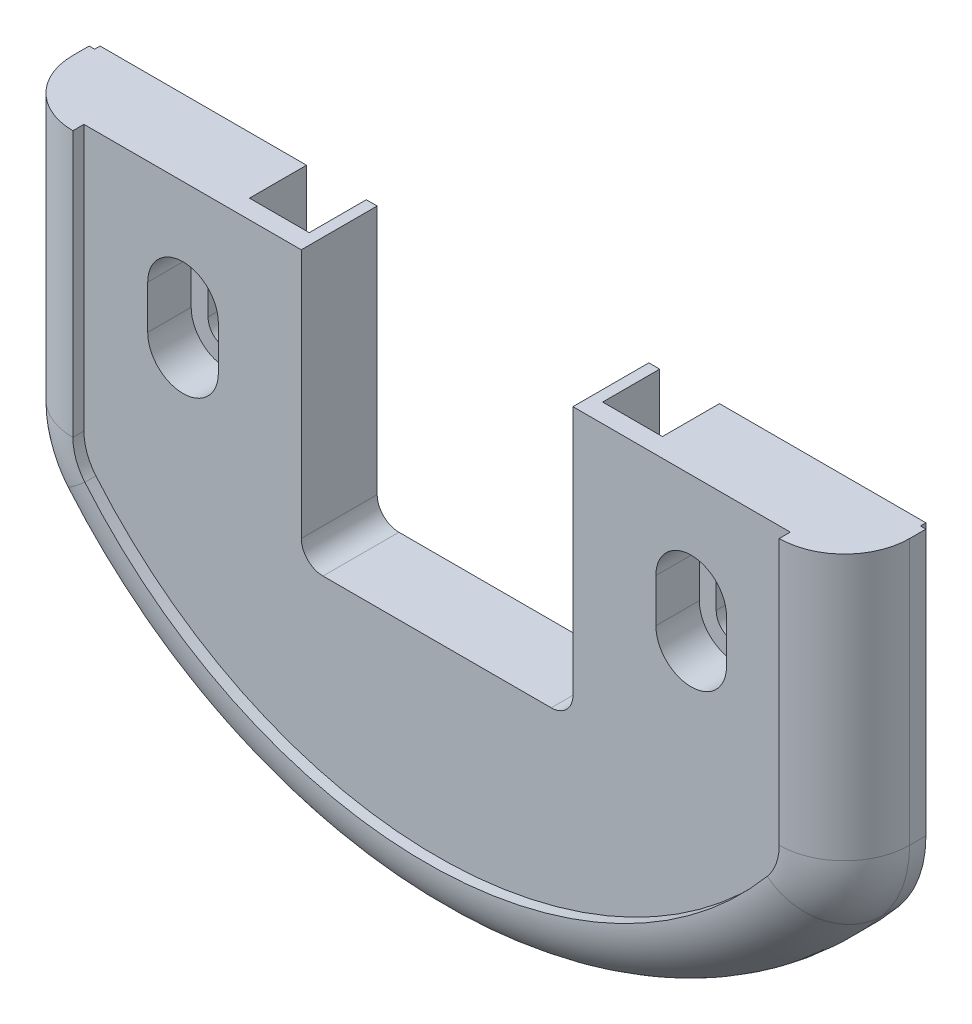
ISO-10303-21;
HEADER;
FILE_DESCRIPTION(('STEP AP214'),'2;1');
FILE_NAME('part.step','',(''),(''),'','','');
FILE_SCHEMA(('AUTOMOTIVE_DESIGN { 1 0 10303 214 1 1 1 1 }'));
ENDSEC;
DATA;
#1=APPLICATION_CONTEXT('core data for automotive mechanical design processes');
#2=APPLICATION_PROTOCOL_DEFINITION('international standard','automotive_design',2000,#1);
#3=PRODUCT_CONTEXT('',#1,'mechanical');
#4=PRODUCT('Part','Part','',(#3));
#5=PRODUCT_RELATED_PRODUCT_CATEGORY('part','',(#4));
#6=PRODUCT_DEFINITION_FORMATION('','',#4);
#7=PRODUCT_DEFINITION_CONTEXT('part definition',#1,'design');
#8=PRODUCT_DEFINITION('design','',#6,#7);
#9=PRODUCT_DEFINITION_SHAPE('','',#8);
#10=(LENGTH_UNIT() NAMED_UNIT(*) SI_UNIT(.MILLI.,.METRE.));
#11=(NAMED_UNIT(*) PLANE_ANGLE_UNIT() SI_UNIT($,.RADIAN.));
#12=(NAMED_UNIT(*) SI_UNIT($,.STERADIAN.) SOLID_ANGLE_UNIT());
#13=UNCERTAINTY_MEASURE_WITH_UNIT(LENGTH_MEASURE(1.E-05),#10,'distance_accuracy_value','');
#14=(GEOMETRIC_REPRESENTATION_CONTEXT(3) GLOBAL_UNCERTAINTY_ASSIGNED_CONTEXT((#13)) GLOBAL_UNIT_ASSIGNED_CONTEXT((#10,
#11,#12)) REPRESENTATION_CONTEXT('',''));
#15=CARTESIAN_POINT('',(0.,0.,0.));
#16=DIRECTION('',(0.,0.,1.));
#17=DIRECTION('',(1.,0.,0.));
#18=AXIS2_PLACEMENT_3D('',#15,#16,#17);
#19=CARTESIAN_POINT('',(12.5,0.,8.));
#20=DIRECTION('',(1.,0.,0.));
#21=DIRECTION('',(0.,1.,0.));
#22=AXIS2_PLACEMENT_3D('',#19,#20,#21);
#23=PLANE('',#22);
#24=DIRECTION('',(0.,-1.,0.));
#25=VECTOR('',#24,1.);
#26=CARTESIAN_POINT('',(12.5,0.,0.));
#27=LINE('',#26,#25);
#28=CARTESIAN_POINT('',(12.5,0.,0.));
#29=VERTEX_POINT('',#28);
#30=CARTESIAN_POINT('',(12.5,-23.,0.));
#31=VERTEX_POINT('',#30);
#32=EDGE_CURVE('E1010',#29,#31,#27,.T.);
#33=ORIENTED_EDGE('',*,*,#32,.T.);
#34=DIRECTION('',(0.,0.,-1.));
#35=VECTOR('',#34,1.);
#36=CARTESIAN_POINT('',(12.5,-23.,6.984));
#37=LINE('',#36,#35);
#38=CARTESIAN_POINT('',(12.5,-23.,6.984));
#39=VERTEX_POINT('',#38);
#40=EDGE_CURVE('E1146',#31,#39,#37,.F.);
#41=ORIENTED_EDGE('',*,*,#40,.T.);
#42=DIRECTION('',(0.,-1.,0.));
#43=VECTOR('',#42,1.);
#44=CARTESIAN_POINT('',(12.5,0.,6.984));
#45=LINE('',#44,#43);
#46=CARTESIAN_POINT('',(12.5,0.,6.984));
#47=VERTEX_POINT('',#46);
#48=EDGE_CURVE('E902',#47,#39,#45,.T.);
#49=ORIENTED_EDGE('',*,*,#48,.F.);
#50=DIRECTION('',(0.,0.,-1.));
#51=VECTOR('',#50,1.);
#52=CARTESIAN_POINT('',(12.5,0.,8.));
#53=LINE('',#52,#51);
#54=EDGE_CURVE('E1032',#47,#29,#53,.T.);
#55=ORIENTED_EDGE('',*,*,#54,.T.);
#56=EDGE_LOOP('',(#33,#41,#49,#55));
#57=FACE_BOUND('',#56,.T.);
#58=ADVANCED_FACE('F304',(#57),#23,.F.);
#59=CARTESIAN_POINT('',(12.5,-25.,8.));
#60=DIRECTION('',(0.,-1.,0.));
#61=DIRECTION('',(1.,0.,0.));
#62=AXIS2_PLACEMENT_3D('',#59,#60,#61);
#63=PLANE('',#62);
#64=DIRECTION('',(-1.,0.,0.));
#65=VECTOR('',#64,1.);
#66=CARTESIAN_POINT('',(12.5,-25.,6.984));
#67=LINE('',#66,#65);
#68=CARTESIAN_POINT('',(10.5,-25.,6.984));
#69=VERTEX_POINT('',#68);
#70=CARTESIAN_POINT('',(-10.5,-25.,6.984));
#71=VERTEX_POINT('',#70);
#72=EDGE_CURVE('E906',#69,#71,#67,.T.);
#73=ORIENTED_EDGE('',*,*,#72,.F.);
#74=DIRECTION('',(0.,0.,-1.));
#75=VECTOR('',#74,1.);
#76=CARTESIAN_POINT('',(10.5,-25.,0.));
#77=LINE('',#76,#75);
#78=CARTESIAN_POINT('',(10.5,-25.,0.));
#79=VERTEX_POINT('',#78);
#80=EDGE_CURVE('E1142',#69,#79,#77,.T.);
#81=ORIENTED_EDGE('',*,*,#80,.T.);
#82=DIRECTION('',(-1.,0.,0.));
#83=VECTOR('',#82,1.);
#84=CARTESIAN_POINT('',(12.5,-25.,0.));
#85=LINE('',#84,#83);
#86=CARTESIAN_POINT('',(-10.5,-25.,0.));
#87=VERTEX_POINT('',#86);
#88=EDGE_CURVE('E1014',#79,#87,#85,.T.);
#89=ORIENTED_EDGE('',*,*,#88,.T.);
#90=DIRECTION('',(0.,0.,-1.));
#91=VECTOR('',#90,1.);
#92=CARTESIAN_POINT('',(-10.5,-25.,6.984));
#93=LINE('',#92,#91);
#94=EDGE_CURVE('E1139',#87,#71,#93,.F.);
#95=ORIENTED_EDGE('',*,*,#94,.T.);
#96=EDGE_LOOP('',(#73,#81,#89,#95));
#97=FACE_BOUND('',#96,.T.);
#98=ADVANCED_FACE('F1223',(#97),#63,.F.);
#99=CARTESIAN_POINT('',(-12.5,0.,8.));
#100=DIRECTION('',(-1.,0.,0.));
#101=DIRECTION('',(0.,-1.,0.));
#102=AXIS2_PLACEMENT_3D('',#99,#100,#101);
#103=PLANE('',#102);
#104=DIRECTION('',(0.,1.,0.));
#105=VECTOR('',#104,1.);
#106=CARTESIAN_POINT('',(-12.5,-25.,6.984));
#107=LINE('',#106,#105);
#108=CARTESIAN_POINT('',(-12.5,-23.,6.984));
#109=VERTEX_POINT('',#108);
#110=CARTESIAN_POINT('',(-12.5,0.,6.984));
#111=VERTEX_POINT('',#110);
#112=EDGE_CURVE('E869',#109,#111,#107,.T.);
#113=ORIENTED_EDGE('',*,*,#112,.F.);
#114=DIRECTION('',(0.,0.,-1.));
#115=VECTOR('',#114,1.);
#116=CARTESIAN_POINT('',(-12.5,-23.,0.));
#117=LINE('',#116,#115);
#118=CARTESIAN_POINT('',(-12.5,-23.,0.));
#119=VERTEX_POINT('',#118);
#120=EDGE_CURVE('E1149',#109,#119,#117,.T.);
#121=ORIENTED_EDGE('',*,*,#120,.T.);
#122=DIRECTION('',(0.,1.,0.));
#123=VECTOR('',#122,1.);
#124=CARTESIAN_POINT('',(-12.5,0.,0.));
#125=LINE('',#124,#123);
#126=CARTESIAN_POINT('',(-12.5,0.,0.));
#127=VERTEX_POINT('',#126);
#128=EDGE_CURVE('E1019',#119,#127,#125,.T.);
#129=ORIENTED_EDGE('',*,*,#128,.T.);
#130=DIRECTION('',(0.,0.,-1.));
#131=VECTOR('',#130,1.);
#132=CARTESIAN_POINT('',(-12.5,0.,8.));
#133=LINE('',#132,#131);
#134=EDGE_CURVE('E1060',#111,#127,#133,.T.);
#135=ORIENTED_EDGE('',*,*,#134,.F.);
#136=EDGE_LOOP('',(#113,#121,#129,#135));
#137=FACE_BOUND('',#136,.T.);
#138=ADVANCED_FACE('F1234',(#137),#103,.F.);
#139=CARTESIAN_POINT('',(-38.5,0.,8.));
#140=DIRECTION('',(1.,0.,0.));
#141=DIRECTION('',(0.,1.,0.));
#142=AXIS2_PLACEMENT_3D('',#139,#140,#141);
#143=PLANE('',#142);
#144=DIRECTION('',(0.,1.,0.));
#145=VECTOR('',#144,1.);
#146=CARTESIAN_POINT('',(-38.5,0.,0.5));
#147=LINE('',#146,#145);
#148=CARTESIAN_POINT('',(-38.5,-24.4463,0.5));
#149=VERTEX_POINT('',#148);
#150=CARTESIAN_POINT('',(-38.5,0.,0.5));
#151=VERTEX_POINT('',#150);
#152=EDGE_CURVE('E939',#149,#151,#147,.T.);
#153=ORIENTED_EDGE('',*,*,#152,.F.);
#154=DIRECTION('',(0.,0.,-1.));
#155=VECTOR('',#154,1.);
#156=CARTESIAN_POINT('',(-38.5,-24.4463,8.));
#157=LINE('',#156,#155);
#158=CARTESIAN_POINT('',(-38.5,-24.4463,2.));
#159=VERTEX_POINT('',#158);
#160=EDGE_CURVE('E1052',#159,#149,#157,.T.);
#161=ORIENTED_EDGE('',*,*,#160,.F.);
#162=DIRECTION('',(0.,-1.,0.));
#163=VECTOR('',#162,1.);
#164=CARTESIAN_POINT('',(-38.5,0.,2.));
#165=LINE('',#164,#163);
#166=CARTESIAN_POINT('',(-38.5,0.,2.));
#167=VERTEX_POINT('',#166);
#168=EDGE_CURVE('E1083',#159,#167,#165,.F.);
#169=ORIENTED_EDGE('',*,*,#168,.T.);
#170=DIRECTION('',(0.,0.,-1.));
#171=VECTOR('',#170,1.);
#172=CARTESIAN_POINT('',(-38.5,0.,8.));
#173=LINE('',#172,#171);
#174=EDGE_CURVE('E1056',#167,#151,#173,.T.);
#175=ORIENTED_EDGE('',*,*,#174,.T.);
#176=EDGE_LOOP('',(#153,#161,#169,#175));
#177=FACE_BOUND('',#176,.T.);
#178=ADVANCED_FACE('F1304',(#177),#143,.F.);
#179=CARTESIAN_POINT('',(-27.8007628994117,-24.4463,8.));
#180=DIRECTION('',(0.,0.,-1.));
#181=DIRECTION('',(-1.,0.,0.));
#182=AXIS2_PLACEMENT_3D('',#179,#180,#181);
#183=CYLINDRICAL_SURFACE('',#182,10.6992371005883);
#184=CARTESIAN_POINT('',(-27.8007628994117,-24.4463,0.5));
#185=DIRECTION('',(0.,0.,-1.));
#186=DIRECTION('',(-1.,0.,0.));
#187=AXIS2_PLACEMENT_3D('',#184,#185,#186);
#188=CIRCLE('',#187,10.6992371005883);
#189=CARTESIAN_POINT('',(-35.9947216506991,-31.3261775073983,0.5));
#190=VERTEX_POINT('',#189);
#191=EDGE_CURVE('E936',#190,#149,#188,.T.);
#192=ORIENTED_EDGE('',*,*,#191,.F.);
#193=DIRECTION('',(0.,0.,-1.));
#194=VECTOR('',#193,1.);
#195=CARTESIAN_POINT('',(-35.9947216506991,-31.3261775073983,8.));
#196=LINE('',#195,#194);
#197=CARTESIAN_POINT('',(-35.9947216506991,-31.3261775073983,2.));
#198=VERTEX_POINT('',#197);
#199=EDGE_CURVE('E1048',#198,#190,#196,.T.);
#200=ORIENTED_EDGE('',*,*,#199,.F.);
#201=CARTESIAN_POINT('',(-27.8007628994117,-24.4463,2.));
#202=DIRECTION('',(0.,0.,1.));
#203=DIRECTION('',(1.,0.,0.));
#204=AXIS2_PLACEMENT_3D('',#201,#202,#203);
#205=CIRCLE('',#204,10.6992371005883);
#206=EDGE_CURVE('E1090',#198,#159,#205,.F.);
#207=ORIENTED_EDGE('',*,*,#206,.T.);
#208=ORIENTED_EDGE('',*,*,#160,.T.);
#209=EDGE_LOOP('',(#192,#200,#207,#208));
#210=FACE_BOUND('',#209,.T.);
#211=ADVANCED_FACE('F1289',(#210),#183,.T.);
#212=CARTESIAN_POINT('',(0.,-1.104,8.));
#213=DIRECTION('',(0.,0.,-1.));
#214=DIRECTION('',(-1.,0.,0.));
#215=AXIS2_PLACEMENT_3D('',#212,#213,#214);
#216=CYLINDRICAL_SURFACE('',#215,47.);
#217=CARTESIAN_POINT('',(0.,-1.104,0.5));
#218=DIRECTION('',(0.,0.,-1.));
#219=DIRECTION('',(-1.,0.,0.));
#220=AXIS2_PLACEMENT_3D('',#217,#218,#219);
#221=CIRCLE('',#220,47.);
#222=CARTESIAN_POINT('',(35.9947216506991,-31.3261775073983,0.5));
#223=VERTEX_POINT('',#222);
#224=EDGE_CURVE('E932',#223,#190,#221,.T.);
#225=ORIENTED_EDGE('',*,*,#224,.F.);
#226=DIRECTION('',(0.,0.,-1.));
#227=VECTOR('',#226,1.);
#228=CARTESIAN_POINT('',(35.9947216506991,-31.3261775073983,8.));
#229=LINE('',#228,#227);
#230=CARTESIAN_POINT('',(35.9947216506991,-31.3261775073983,2.));
#231=VERTEX_POINT('',#230);
#232=EDGE_CURVE('E1044',#231,#223,#229,.T.);
#233=ORIENTED_EDGE('',*,*,#232,.F.);
#234=CARTESIAN_POINT('',(0.,-1.104,2.));
#235=DIRECTION('',(0.,0.,1.));
#236=DIRECTION('',(1.,0.,0.));
#237=AXIS2_PLACEMENT_3D('',#234,#235,#236);
#238=CIRCLE('',#237,47.);
#239=EDGE_CURVE('E1102',#231,#198,#238,.F.);
#240=ORIENTED_EDGE('',*,*,#239,.T.);
#241=ORIENTED_EDGE('',*,*,#199,.T.);
#242=EDGE_LOOP('',(#225,#233,#240,#241));
#243=FACE_BOUND('',#242,.T.);
#244=ADVANCED_FACE('F1283',(#243),#216,.T.);
#245=CARTESIAN_POINT('',(27.8007628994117,-24.4463,8.));
#246=DIRECTION('',(0.,0.,-1.));
#247=DIRECTION('',(-1.,0.,0.));
#248=AXIS2_PLACEMENT_3D('',#245,#246,#247);
#249=CYLINDRICAL_SURFACE('',#248,10.6992371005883);
#250=CARTESIAN_POINT('',(27.8007628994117,-24.4463,0.5));
#251=DIRECTION('',(0.,0.,-1.));
#252=DIRECTION('',(-1.,0.,0.));
#253=AXIS2_PLACEMENT_3D('',#250,#251,#252);
#254=CIRCLE('',#253,10.6992371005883);
#255=CARTESIAN_POINT('',(38.5,-24.4463,0.5));
#256=VERTEX_POINT('',#255);
#257=EDGE_CURVE('E929',#256,#223,#254,.T.);
#258=ORIENTED_EDGE('',*,*,#257,.F.);
#259=DIRECTION('',(0.,0.,-1.));
#260=VECTOR('',#259,1.);
#261=CARTESIAN_POINT('',(38.5,-24.4463,8.));
#262=LINE('',#261,#260);
#263=CARTESIAN_POINT('',(38.5,-24.4463,2.));
#264=VERTEX_POINT('',#263);
#265=EDGE_CURVE('E1040',#264,#256,#262,.T.);
#266=ORIENTED_EDGE('',*,*,#265,.F.);
#267=CARTESIAN_POINT('',(27.8007628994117,-24.4463,2.));
#268=DIRECTION('',(0.,0.,1.));
#269=DIRECTION('',(1.,0.,0.));
#270=AXIS2_PLACEMENT_3D('',#267,#268,#269);
#271=CIRCLE('',#270,10.6992371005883);
#272=EDGE_CURVE('E1099',#264,#231,#271,.F.);
#273=ORIENTED_EDGE('',*,*,#272,.T.);
#274=ORIENTED_EDGE('',*,*,#232,.T.);
#275=EDGE_LOOP('',(#258,#266,#273,#274));
#276=FACE_BOUND('',#275,.T.);
#277=ADVANCED_FACE('F1276',(#276),#249,.T.);
#278=CARTESIAN_POINT('',(38.5,0.,8.));
#279=DIRECTION('',(-1.,0.,0.));
#280=DIRECTION('',(0.,-1.,0.));
#281=AXIS2_PLACEMENT_3D('',#278,#279,#280);
#282=PLANE('',#281);
#283=DIRECTION('',(0.,-1.,0.));
#284=VECTOR('',#283,1.);
#285=CARTESIAN_POINT('',(38.5,-24.4463,0.5));
#286=LINE('',#285,#284);
#287=CARTESIAN_POINT('',(38.5,0.,0.5));
#288=VERTEX_POINT('',#287);
#289=EDGE_CURVE('E969',#288,#256,#286,.T.);
#290=ORIENTED_EDGE('',*,*,#289,.F.);
#291=DIRECTION('',(0.,0.,-1.));
#292=VECTOR('',#291,1.);
#293=CARTESIAN_POINT('',(38.5,0.,8.));
#294=LINE('',#293,#292);
#295=CARTESIAN_POINT('',(38.5,0.,2.));
#296=VERTEX_POINT('',#295);
#297=EDGE_CURVE('E1036',#296,#288,#294,.T.);
#298=ORIENTED_EDGE('',*,*,#297,.F.);
#299=DIRECTION('',(0.,1.,0.));
#300=VECTOR('',#299,1.);
#301=CARTESIAN_POINT('',(38.5,-24.4463,2.));
#302=LINE('',#301,#300);
#303=EDGE_CURVE('E1096',#296,#264,#302,.F.);
#304=ORIENTED_EDGE('',*,*,#303,.T.);
#305=ORIENTED_EDGE('',*,*,#265,.T.);
#306=EDGE_LOOP('',(#290,#298,#304,#305));
#307=FACE_BOUND('',#306,.T.);
#308=ADVANCED_FACE('F1273',(#307),#282,.F.);
#309=CARTESIAN_POINT('',(-12.5,0.,8.));
#310=DIRECTION('',(0.,-1.,0.));
#311=DIRECTION('',(1.,0.,0.));
#312=AXIS2_PLACEMENT_3D('',#309,#310,#311);
#313=PLANE('',#312);
#314=DIRECTION('',(-1.,0.,0.));
#315=VECTOR('',#314,1.);
#316=CARTESIAN_POINT('',(-12.5,0.,0.));
#317=LINE('',#316,#315);
#318=CARTESIAN_POINT('',(-13.5,0.,0.));
#319=VERTEX_POINT('',#318);
#320=EDGE_CURVE('E1023',#127,#319,#317,.T.);
#321=ORIENTED_EDGE('',*,*,#320,.T.);
#322=DIRECTION('',(0.,0.,-1.));
#323=VECTOR('',#322,1.);
#324=CARTESIAN_POINT('',(-13.5,0.,5.25));
#325=LINE('',#324,#323);
#326=CARTESIAN_POINT('',(-13.5,0.,5.25));
#327=VERTEX_POINT('',#326);
#328=EDGE_CURVE('E866',#327,#319,#325,.T.);
#329=ORIENTED_EDGE('',*,*,#328,.F.);
#330=DIRECTION('',(1.,0.,0.));
#331=VECTOR('',#330,1.);
#332=CARTESIAN_POINT('',(-13.5,0.,5.25));
#333=LINE('',#332,#331);
#334=CARTESIAN_POINT('',(-19.,0.,5.25));
#335=VERTEX_POINT('',#334);
#336=EDGE_CURVE('E852',#335,#327,#333,.T.);
#337=ORIENTED_EDGE('',*,*,#336,.F.);
#338=DIRECTION('',(0.,0.,-1.));
#339=VECTOR('',#338,1.);
#340=CARTESIAN_POINT('',(-19.,0.,5.25));
#341=LINE('',#340,#339);
#342=CARTESIAN_POINT('',(-19.,0.,0.));
#343=VERTEX_POINT('',#342);
#344=EDGE_CURVE('E856',#335,#343,#341,.T.);
#345=ORIENTED_EDGE('',*,*,#344,.T.);
#346=CARTESIAN_POINT('',(-38.,0.,0.));
#347=VERTEX_POINT('',#346);
#348=EDGE_CURVE('E1022',#343,#347,#317,.T.);
#349=ORIENTED_EDGE('',*,*,#348,.T.);
#350=DIRECTION('',(0.,0.,-1.));
#351=VECTOR('',#350,1.);
#352=CARTESIAN_POINT('',(-38.,0.,0.5));
#353=LINE('',#352,#351);
#354=CARTESIAN_POINT('',(-38.,0.,0.5));
#355=VERTEX_POINT('',#354);
#356=EDGE_CURVE('E972',#355,#347,#353,.T.);
#357=ORIENTED_EDGE('',*,*,#356,.F.);
#358=DIRECTION('',(1.,0.,0.));
#359=VECTOR('',#358,1.);
#360=CARTESIAN_POINT('',(-38.,0.,0.5));
#361=LINE('',#360,#359);
#362=EDGE_CURVE('E942',#151,#355,#361,.T.);
#363=ORIENTED_EDGE('',*,*,#362,.F.);
#364=ORIENTED_EDGE('',*,*,#174,.F.);
#365=CARTESIAN_POINT('',(-32.5,0.,2.));
#366=DIRECTION('',(0.,-1.,0.));
#367=DIRECTION('',(1.,0.,0.));
#368=AXIS2_PLACEMENT_3D('',#365,#366,#367);
#369=CIRCLE('',#368,6.);
#370=CARTESIAN_POINT('',(-32.5,0.,8.));
#371=VERTEX_POINT('',#370);
#372=EDGE_CURVE('E1086',#167,#371,#369,.F.);
#373=ORIENTED_EDGE('',*,*,#372,.T.);
#374=DIRECTION('',(0.,0.,1.));
#375=VECTOR('',#374,1.);
#376=CARTESIAN_POINT('',(-32.5,0.,6.984));
#377=LINE('',#376,#375);
#378=CARTESIAN_POINT('',(-32.5,0.,6.984));
#379=VERTEX_POINT('',#378);
#380=EDGE_CURVE('E910',#379,#371,#377,.T.);
#381=ORIENTED_EDGE('',*,*,#380,.F.);
#382=DIRECTION('',(-1.,0.,0.));
#383=VECTOR('',#382,1.);
#384=CARTESIAN_POINT('',(-12.5,0.,6.984));
#385=LINE('',#384,#383);
#386=EDGE_CURVE('E875',#111,#379,#385,.T.);
#387=ORIENTED_EDGE('',*,*,#386,.F.);
#388=ORIENTED_EDGE('',*,*,#134,.T.);
#389=EDGE_LOOP('',(#321,#329,#337,#345,#349,#357,#363,#364,#373,#381,#387,#388));
#390=FACE_BOUND('',#389,.T.);
#391=ADVANCED_FACE('F1240',(#390),#313,.F.);
#392=CARTESIAN_POINT('',(12.5,0.,8.));
#393=DIRECTION('',(0.,-1.,0.));
#394=DIRECTION('',(1.,0.,0.));
#395=AXIS2_PLACEMENT_3D('',#392,#393,#394);
#396=PLANE('',#395);
#397=DIRECTION('',(1.,0.,0.));
#398=VECTOR('',#397,1.);
#399=CARTESIAN_POINT('',(13.5,0.,5.25));
#400=LINE('',#399,#398);
#401=CARTESIAN_POINT('',(13.5,0.,5.25));
#402=VERTEX_POINT('',#401);
#403=CARTESIAN_POINT('',(19.,0.,5.25));
#404=VERTEX_POINT('',#403);
#405=EDGE_CURVE('E807',#402,#404,#400,.T.);
#406=ORIENTED_EDGE('',*,*,#405,.F.);
#407=DIRECTION('',(0.,0.,-1.));
#408=VECTOR('',#407,1.);
#409=CARTESIAN_POINT('',(13.5,0.,5.25));
#410=LINE('',#409,#408);
#411=CARTESIAN_POINT('',(13.5,0.,0.));
#412=VERTEX_POINT('',#411);
#413=EDGE_CURVE('E833',#402,#412,#410,.T.);
#414=ORIENTED_EDGE('',*,*,#413,.T.);
#415=DIRECTION('',(-1.,0.,0.));
#416=VECTOR('',#415,1.);
#417=CARTESIAN_POINT('',(12.5,0.,0.));
#418=LINE('',#417,#416);
#419=EDGE_CURVE('E1027',#412,#29,#418,.T.);
#420=ORIENTED_EDGE('',*,*,#419,.T.);
#421=ORIENTED_EDGE('',*,*,#54,.F.);
#422=DIRECTION('',(-1.,0.,0.));
#423=VECTOR('',#422,1.);
#424=CARTESIAN_POINT('',(32.5,0.,6.984));
#425=LINE('',#424,#423);
#426=CARTESIAN_POINT('',(32.5,0.,6.984));
#427=VERTEX_POINT('',#426);
#428=EDGE_CURVE('E899',#427,#47,#425,.T.);
#429=ORIENTED_EDGE('',*,*,#428,.F.);
#430=DIRECTION('',(0.,0.,1.));
#431=VECTOR('',#430,1.);
#432=CARTESIAN_POINT('',(32.5,0.,6.984));
#433=LINE('',#432,#431);
#434=CARTESIAN_POINT('',(32.5,0.,8.));
#435=VERTEX_POINT('',#434);
#436=EDGE_CURVE('E911',#427,#435,#433,.T.);
#437=ORIENTED_EDGE('',*,*,#436,.T.);
#438=CARTESIAN_POINT('',(32.5,0.,2.));
#439=DIRECTION('',(0.,-1.,0.));
#440=DIRECTION('',(1.,0.,0.));
#441=AXIS2_PLACEMENT_3D('',#438,#439,#440);
#442=CIRCLE('',#441,6.);
#443=EDGE_CURVE('E1093',#435,#296,#442,.F.);
#444=ORIENTED_EDGE('',*,*,#443,.T.);
#445=ORIENTED_EDGE('',*,*,#297,.T.);
#446=DIRECTION('',(1.,0.,0.));
#447=VECTOR('',#446,1.);
#448=CARTESIAN_POINT('',(38.5,0.,0.5));
#449=LINE('',#448,#447);
#450=CARTESIAN_POINT('',(38.,0.,0.5));
#451=VERTEX_POINT('',#450);
#452=EDGE_CURVE('E966',#451,#288,#449,.T.);
#453=ORIENTED_EDGE('',*,*,#452,.F.);
#454=DIRECTION('',(0.,0.,-1.));
#455=VECTOR('',#454,1.);
#456=CARTESIAN_POINT('',(38.,0.,0.5));
#457=LINE('',#456,#455);
#458=CARTESIAN_POINT('',(38.,0.,0.));
#459=VERTEX_POINT('',#458);
#460=EDGE_CURVE('E990',#451,#459,#457,.T.);
#461=ORIENTED_EDGE('',*,*,#460,.T.);
#462=CARTESIAN_POINT('',(19.,0.,0.));
#463=VERTEX_POINT('',#462);
#464=EDGE_CURVE('E1028',#459,#463,#418,.T.);
#465=ORIENTED_EDGE('',*,*,#464,.T.);
#466=DIRECTION('',(0.,0.,-1.));
#467=VECTOR('',#466,1.);
#468=CARTESIAN_POINT('',(19.,0.,5.25));
#469=LINE('',#468,#467);
#470=EDGE_CURVE('E823',#404,#463,#469,.T.);
#471=ORIENTED_EDGE('',*,*,#470,.F.);
#472=EDGE_LOOP('',(#406,#414,#420,#421,#429,#437,#444,#445,#453,#461,#465,#471));
#473=FACE_BOUND('',#472,.T.);
#474=ADVANCED_FACE('F1207',(#473),#396,.F.);
#475=CARTESIAN_POINT('',(-27.8007628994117,-24.4463,0.));
#476=DIRECTION('',(0.,0.,1.));
#477=DIRECTION('',(1.,0.,0.));
#478=AXIS2_PLACEMENT_3D('',#475,#476,#477);
#479=PLANE('',#478);
#480=CARTESIAN_POINT('',(23.3811190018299,-9.6429999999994,0.));
#481=DIRECTION('',(0.,0.,1.));
#482=DIRECTION('',(-1.,0.,0.));
#483=AXIS2_PLACEMENT_3D('',#480,#481,#482);
#484=CIRCLE('',#483,1.69999999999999);
#485=CARTESIAN_POINT('',(25.0811190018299,-9.6429999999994,0.));
#486=VERTEX_POINT('',#485);
#487=CARTESIAN_POINT('',(21.6811190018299,-9.6429999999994,0.));
#488=VERTEX_POINT('',#487);
#489=EDGE_CURVE('E320',#486,#488,#484,.T.);
#490=ORIENTED_EDGE('',*,*,#489,.T.);
#491=DIRECTION('',(0.,-1.,0.));
#492=VECTOR('',#491,1.);
#493=CARTESIAN_POINT('',(21.6811190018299,-13.6429999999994,0.));
#494=LINE('',#493,#492);
#495=CARTESIAN_POINT('',(21.6811190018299,-13.6429999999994,0.));
#496=VERTEX_POINT('',#495);
#497=EDGE_CURVE('E652',#488,#496,#494,.T.);
#498=ORIENTED_EDGE('',*,*,#497,.T.);
#499=CARTESIAN_POINT('',(23.3811190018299,-13.6429999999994,0.));
#500=DIRECTION('',(0.,0.,1.));
#501=DIRECTION('',(-1.,0.,0.));
#502=AXIS2_PLACEMENT_3D('',#499,#500,#501);
#503=CIRCLE('',#502,1.69999999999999);
#504=CARTESIAN_POINT('',(25.0811190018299,-13.6429999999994,0.));
#505=VERTEX_POINT('',#504);
#506=EDGE_CURVE('E643',#496,#505,#503,.T.);
#507=ORIENTED_EDGE('',*,*,#506,.T.);
#508=DIRECTION('',(0.,1.,0.));
#509=VECTOR('',#508,1.);
#510=CARTESIAN_POINT('',(25.0811190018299,-13.6429999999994,0.));
#511=LINE('',#510,#509);
#512=EDGE_CURVE('E635',#505,#486,#511,.T.);
#513=ORIENTED_EDGE('',*,*,#512,.T.);
#514=EDGE_LOOP('',(#490,#498,#507,#513));
#515=FACE_BOUND('',#514,.T.);
#516=CARTESIAN_POINT('',(-23.3811190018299,-9.64299999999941,0.));
#517=DIRECTION('',(0.,0.,1.));
#518=DIRECTION('',(1.,0.,0.));
#519=AXIS2_PLACEMENT_3D('',#516,#517,#518);
#520=CIRCLE('',#519,1.69999999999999);
#521=CARTESIAN_POINT('',(-21.6811190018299,-9.64299999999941,0.));
#522=VERTEX_POINT('',#521);
#523=CARTESIAN_POINT('',(-25.0811190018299,-9.64299999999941,0.));
#524=VERTEX_POINT('',#523);
#525=EDGE_CURVE('E690',#522,#524,#520,.T.);
#526=ORIENTED_EDGE('',*,*,#525,.T.);
#527=DIRECTION('',(0.,-1.,0.));
#528=VECTOR('',#527,1.);
#529=CARTESIAN_POINT('',(-25.0811190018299,-13.6429999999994,0.));
#530=LINE('',#529,#528);
#531=CARTESIAN_POINT('',(-25.0811190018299,-13.6429999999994,0.));
#532=VERTEX_POINT('',#531);
#533=EDGE_CURVE('E694',#524,#532,#530,.T.);
#534=ORIENTED_EDGE('',*,*,#533,.T.);
#535=CARTESIAN_POINT('',(-23.3811190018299,-13.6429999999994,0.));
#536=DIRECTION('',(0.,0.,1.));
#537=DIRECTION('',(1.,0.,0.));
#538=AXIS2_PLACEMENT_3D('',#535,#536,#537);
#539=CIRCLE('',#538,1.69999999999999);
#540=CARTESIAN_POINT('',(-21.6811190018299,-13.6429999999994,0.));
#541=VERTEX_POINT('',#540);
#542=EDGE_CURVE('E681',#532,#541,#539,.T.);
#543=ORIENTED_EDGE('',*,*,#542,.T.);
#544=DIRECTION('',(0.,1.,0.));
#545=VECTOR('',#544,1.);
#546=CARTESIAN_POINT('',(-21.6811190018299,-13.6429999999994,0.));
#547=LINE('',#546,#545);
#548=EDGE_CURVE('E685',#541,#522,#547,.T.);
#549=ORIENTED_EDGE('',*,*,#548,.T.);
#550=EDGE_LOOP('',(#526,#534,#543,#549));
#551=FACE_BOUND('',#550,.T.);
#552=ORIENTED_EDGE('',*,*,#419,.F.);
#553=DIRECTION('',(0.,1.,0.));
#554=VECTOR('',#553,1.);
#555=CARTESIAN_POINT('',(13.5,0.,0.));
#556=LINE('',#555,#554);
#557=CARTESIAN_POINT('',(13.5,-18.,0.));
#558=VERTEX_POINT('',#557);
#559=EDGE_CURVE('E812',#558,#412,#556,.T.);
#560=ORIENTED_EDGE('',*,*,#559,.F.);
#561=CARTESIAN_POINT('',(15.5,-18.,0.));
#562=DIRECTION('',(0.,0.,1.));
#563=DIRECTION('',(1.,0.,0.));
#564=AXIS2_PLACEMENT_3D('',#561,#562,#563);
#565=CIRCLE('',#564,2.);
#566=CARTESIAN_POINT('',(15.5,-20.,0.));
#567=VERTEX_POINT('',#566);
#568=EDGE_CURVE('E1173',#558,#567,#565,.T.);
#569=ORIENTED_EDGE('',*,*,#568,.T.);
#570=DIRECTION('',(-1.,0.,0.));
#571=VECTOR('',#570,1.);
#572=CARTESIAN_POINT('',(13.5,-20.,0.));
#573=LINE('',#572,#571);
#574=CARTESIAN_POINT('',(17.,-20.,0.));
#575=VERTEX_POINT('',#574);
#576=EDGE_CURVE('E827',#575,#567,#573,.T.);
#577=ORIENTED_EDGE('',*,*,#576,.F.);
#578=CARTESIAN_POINT('',(17.,-18.,0.));
#579=DIRECTION('',(0.,0.,1.));
#580=DIRECTION('',(1.,0.,0.));
#581=AXIS2_PLACEMENT_3D('',#578,#579,#580);
#582=CIRCLE('',#581,2.);
#583=CARTESIAN_POINT('',(19.,-18.,0.));
#584=VERTEX_POINT('',#583);
#585=EDGE_CURVE('E1176',#575,#584,#582,.T.);
#586=ORIENTED_EDGE('',*,*,#585,.T.);
#587=DIRECTION('',(0.,-1.,0.));
#588=VECTOR('',#587,1.);
#589=CARTESIAN_POINT('',(19.,0.,0.));
#590=LINE('',#589,#588);
#591=EDGE_CURVE('E806',#463,#584,#590,.T.);
#592=ORIENTED_EDGE('',*,*,#591,.F.);
#593=ORIENTED_EDGE('',*,*,#464,.F.);
#594=DIRECTION('',(0.,1.,0.));
#595=VECTOR('',#594,1.);
#596=CARTESIAN_POINT('',(38.,-24.4463,0.));
#597=LINE('',#596,#595);
#598=CARTESIAN_POINT('',(38.,-24.4463,0.));
#599=VERTEX_POINT('',#598);
#600=EDGE_CURVE('E933',#599,#459,#597,.T.);
#601=ORIENTED_EDGE('',*,*,#600,.F.);
#602=CARTESIAN_POINT('',(27.8007628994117,-24.4463,0.));
#603=DIRECTION('',(0.,0.,1.));
#604=DIRECTION('',(-1.,0.,0.));
#605=AXIS2_PLACEMENT_3D('',#602,#603,#604);
#606=CIRCLE('',#605,10.1992371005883);
#607=CARTESIAN_POINT('',(35.611799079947,-31.0046649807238,0.));
#608=VERTEX_POINT('',#607);
#609=EDGE_CURVE('E984',#608,#599,#606,.T.);
#610=ORIENTED_EDGE('',*,*,#609,.F.);
#611=CARTESIAN_POINT('',(0.,-1.104,0.));
#612=DIRECTION('',(0.,0.,1.));
#613=DIRECTION('',(-1.,0.,0.));
#614=AXIS2_PLACEMENT_3D('',#611,#612,#613);
#615=CIRCLE('',#614,46.5);
#616=CARTESIAN_POINT('',(-35.611799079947,-31.0046649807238,0.));
#617=VERTEX_POINT('',#616);
#618=EDGE_CURVE('E980',#617,#608,#615,.T.);
#619=ORIENTED_EDGE('',*,*,#618,.F.);
#620=CARTESIAN_POINT('',(-27.8007628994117,-24.4463,0.));
#621=DIRECTION('',(0.,0.,1.));
#622=DIRECTION('',(-1.,0.,0.));
#623=AXIS2_PLACEMENT_3D('',#620,#621,#622);
#624=CIRCLE('',#623,10.1992371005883);
#625=CARTESIAN_POINT('',(-38.,-24.4463,0.));
#626=VERTEX_POINT('',#625);
#627=EDGE_CURVE('E976',#626,#617,#624,.T.);
#628=ORIENTED_EDGE('',*,*,#627,.F.);
#629=DIRECTION('',(0.,-1.,0.));
#630=VECTOR('',#629,1.);
#631=CARTESIAN_POINT('',(-38.,0.,0.));
#632=LINE('',#631,#630);
#633=EDGE_CURVE('E914',#347,#626,#632,.T.);
#634=ORIENTED_EDGE('',*,*,#633,.F.);
#635=ORIENTED_EDGE('',*,*,#348,.F.);
#636=DIRECTION('',(0.,1.,0.));
#637=VECTOR('',#636,1.);
#638=CARTESIAN_POINT('',(-19.,0.,0.));
#639=LINE('',#638,#637);
#640=CARTESIAN_POINT('',(-19.,-18.,0.));
#641=VERTEX_POINT('',#640);
#642=EDGE_CURVE('E845',#641,#343,#639,.T.);
#643=ORIENTED_EDGE('',*,*,#642,.F.);
#644=CARTESIAN_POINT('',(-17.,-18.,0.));
#645=DIRECTION('',(0.,0.,1.));
#646=DIRECTION('',(1.,0.,0.));
#647=AXIS2_PLACEMENT_3D('',#644,#645,#646);
#648=CIRCLE('',#647,2.);
#649=CARTESIAN_POINT('',(-17.,-20.,0.));
#650=VERTEX_POINT('',#649);
#651=EDGE_CURVE('E1193',#641,#650,#648,.T.);
#652=ORIENTED_EDGE('',*,*,#651,.T.);
#653=DIRECTION('',(-1.,0.,0.));
#654=VECTOR('',#653,1.);
#655=CARTESIAN_POINT('',(-13.5,-20.,0.));
#656=LINE('',#655,#654);
#657=CARTESIAN_POINT('',(-15.5,-20.,0.));
#658=VERTEX_POINT('',#657);
#659=EDGE_CURVE('E860',#658,#650,#656,.T.);
#660=ORIENTED_EDGE('',*,*,#659,.F.);
#661=CARTESIAN_POINT('',(-15.5,-18.,0.));
#662=DIRECTION('',(0.,0.,1.));
#663=DIRECTION('',(1.,0.,0.));
#664=AXIS2_PLACEMENT_3D('',#661,#662,#663);
#665=CIRCLE('',#664,2.);
#666=CARTESIAN_POINT('',(-13.5,-18.,0.));
#667=VERTEX_POINT('',#666);
#668=EDGE_CURVE('E1191',#658,#667,#665,.T.);
#669=ORIENTED_EDGE('',*,*,#668,.T.);
#670=DIRECTION('',(0.,-1.,0.));
#671=VECTOR('',#670,1.);
#672=CARTESIAN_POINT('',(-13.5,0.,0.));
#673=LINE('',#672,#671);
#674=EDGE_CURVE('E837',#319,#667,#673,.T.);
#675=ORIENTED_EDGE('',*,*,#674,.F.);
#676=ORIENTED_EDGE('',*,*,#320,.F.);
#677=ORIENTED_EDGE('',*,*,#128,.F.);
#678=CARTESIAN_POINT('',(-10.5,-23.,0.));
#679=DIRECTION('',(0.,0.,1.));
#680=DIRECTION('',(1.,0.,0.));
#681=AXIS2_PLACEMENT_3D('',#678,#679,#680);
#682=CIRCLE('',#681,2.);
#683=EDGE_CURVE('E1185',#119,#87,#682,.T.);
#684=ORIENTED_EDGE('',*,*,#683,.T.);
#685=ORIENTED_EDGE('',*,*,#88,.F.);
#686=CARTESIAN_POINT('',(10.5,-23.,0.));
#687=DIRECTION('',(0.,0.,1.));
#688=DIRECTION('',(1.,0.,0.));
#689=AXIS2_PLACEMENT_3D('',#686,#687,#688);
#690=CIRCLE('',#689,2.);
#691=EDGE_CURVE('E1179',#79,#31,#690,.T.);
#692=ORIENTED_EDGE('',*,*,#691,.T.);
#693=ORIENTED_EDGE('',*,*,#32,.F.);
#694=EDGE_LOOP('',(#552,#560,#569,#577,#586,#592,#593,#601,#610,#619,#628,#634,#635,#643,#652,
#660,#669,#675,#676,#677,#684,#685,#692,#693));
#695=FACE_BOUND('',#694,.T.);
#696=ADVANCED_FACE('F654',(#515,#551,#695),#479,.F.);
#697=CARTESIAN_POINT('',(32.5,-24.4463,2.));
#698=DIRECTION('',(0.,-1.,0.));
#699=DIRECTION('',(1.,0.,0.));
#700=AXIS2_PLACEMENT_3D('',#697,#698,#699);
#701=CYLINDRICAL_SURFACE('',#700,6.);
#702=ORIENTED_EDGE('',*,*,#443,.F.);
#703=DIRECTION('',(0.,1.,0.));
#704=VECTOR('',#703,1.);
#705=CARTESIAN_POINT('',(32.5,0.,8.));
#706=LINE('',#705,#704);
#707=CARTESIAN_POINT('',(32.5,-24.4463,8.));
#708=VERTEX_POINT('',#707);
#709=EDGE_CURVE('E1072',#708,#435,#706,.T.);
#710=ORIENTED_EDGE('',*,*,#709,.F.);
#711=CARTESIAN_POINT('',(32.5,-24.4463,2.));
#712=DIRECTION('',(0.,-1.,0.));
#713=DIRECTION('',(0.,0.,-1.));
#714=AXIS2_PLACEMENT_3D('',#711,#712,#713);
#715=CIRCLE('',#714,6.);
#716=EDGE_CURVE('E1015',#264,#708,#715,.T.);
#717=ORIENTED_EDGE('',*,*,#716,.F.);
#718=ORIENTED_EDGE('',*,*,#303,.F.);
#719=EDGE_LOOP('',(#702,#710,#717,#718));
#720=FACE_BOUND('',#719,.T.);
#721=ADVANCED_FACE('F1267',(#720),#701,.T.);
#722=CARTESIAN_POINT('',(27.8007628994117,-24.4463,2.));
#723=DIRECTION('',(0.,0.,1.));
#724=DIRECTION('',(1.,0.,0.));
#725=AXIS2_PLACEMENT_3D('',#722,#723,#724);
#726=DEGENERATE_TOROIDAL_SURFACE('',#725,4.69923710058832,6.,.T.);
#727=ORIENTED_EDGE('',*,*,#716,.T.);
#728=CARTESIAN_POINT('',(27.8007628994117,-24.4463,8.));
#729=DIRECTION('',(0.,0.,1.));
#730=DIRECTION('',(1.,0.,0.));
#731=AXIS2_PLACEMENT_3D('',#728,#729,#730);
#732=CIRCLE('',#731,4.69923710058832);
#733=CARTESIAN_POINT('',(31.3996508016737,-27.4680271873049,8.));
#734=VERTEX_POINT('',#733);
#735=EDGE_CURVE('E1068',#734,#708,#732,.T.);
#736=ORIENTED_EDGE('',*,*,#735,.F.);
#737=CARTESIAN_POINT('',(31.3996508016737,-27.4680271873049,2.));
#738=DIRECTION('',(-0.6430250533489,-0.765845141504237,0.));
#739=DIRECTION('',(0.765845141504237,-0.6430250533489,0.));
#740=AXIS2_PLACEMENT_3D('',#737,#738,#739);
#741=CIRCLE('',#740,6.);
#742=EDGE_CURVE('E1113',#231,#734,#741,.T.);
#743=ORIENTED_EDGE('',*,*,#742,.F.);
#744=ORIENTED_EDGE('',*,*,#272,.F.);
#745=EDGE_LOOP('',(#727,#736,#743,#744));
#746=FACE_BOUND('',#745,.T.);
#747=ADVANCED_FACE('F1377',(#746),#726,.T.);
#748=CARTESIAN_POINT('',(0.,-1.104,2.));
#749=DIRECTION('',(0.,0.,1.));
#750=DIRECTION('',(1.,0.,0.));
#751=AXIS2_PLACEMENT_3D('',#748,#749,#750);
#752=TOROIDAL_SURFACE('',#751,41.,6.);
#753=ORIENTED_EDGE('',*,*,#742,.T.);
#754=CARTESIAN_POINT('',(0.,-1.104,8.));
#755=DIRECTION('',(0.,0.,1.));
#756=DIRECTION('',(1.,0.,0.));
#757=AXIS2_PLACEMENT_3D('',#754,#755,#756);
#758=CIRCLE('',#757,41.);
#759=CARTESIAN_POINT('',(-31.3996508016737,-27.4680271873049,8.));
#760=VERTEX_POINT('',#759);
#761=EDGE_CURVE('E1064',#760,#734,#758,.T.);
#762=ORIENTED_EDGE('',*,*,#761,.F.);
#763=CARTESIAN_POINT('',(-31.3996508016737,-27.4680271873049,2.));
#764=DIRECTION('',(-0.6430250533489,0.765845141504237,0.));
#765=DIRECTION('',(-0.765845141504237,-0.6430250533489,0.));
#766=AXIS2_PLACEMENT_3D('',#763,#764,#765);
#767=CIRCLE('',#766,6.);
#768=EDGE_CURVE('E1109',#198,#760,#767,.T.);
#769=ORIENTED_EDGE('',*,*,#768,.F.);
#770=ORIENTED_EDGE('',*,*,#239,.F.);
#771=EDGE_LOOP('',(#753,#762,#769,#770));
#772=FACE_BOUND('',#771,.T.);
#773=ADVANCED_FACE('F1293',(#772),#752,.T.);
#774=CARTESIAN_POINT('',(-27.8007628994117,-24.4463,2.));
#775=DIRECTION('',(0.,0.,1.));
#776=DIRECTION('',(1.,0.,0.));
#777=AXIS2_PLACEMENT_3D('',#774,#775,#776);
#778=DEGENERATE_TOROIDAL_SURFACE('',#777,4.69923710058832,6.,.T.);
#779=ORIENTED_EDGE('',*,*,#768,.T.);
#780=CARTESIAN_POINT('',(-27.8007628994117,-24.4463,8.));
#781=DIRECTION('',(0.,0.,1.));
#782=DIRECTION('',(1.,0.,0.));
#783=AXIS2_PLACEMENT_3D('',#780,#781,#782);
#784=CIRCLE('',#783,4.69923710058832);
#785=CARTESIAN_POINT('',(-32.5,-24.4463,8.));
#786=VERTEX_POINT('',#785);
#787=EDGE_CURVE('E1075',#786,#760,#784,.T.);
#788=ORIENTED_EDGE('',*,*,#787,.F.);
#789=CARTESIAN_POINT('',(-32.5,-24.4463,2.));
#790=DIRECTION('',(0.,1.,0.));
#791=DIRECTION('',(-1.,0.,0.));
#792=AXIS2_PLACEMENT_3D('',#789,#790,#791);
#793=CIRCLE('',#792,6.);
#794=EDGE_CURVE('E994',#159,#786,#793,.T.);
#795=ORIENTED_EDGE('',*,*,#794,.F.);
#796=ORIENTED_EDGE('',*,*,#206,.F.);
#797=EDGE_LOOP('',(#779,#788,#795,#796));
#798=FACE_BOUND('',#797,.T.);
#799=ADVANCED_FACE('F1296',(#798),#778,.T.);
#800=CARTESIAN_POINT('',(-32.5,-24.4463,2.));
#801=DIRECTION('',(0.,1.,0.));
#802=DIRECTION('',(-1.,0.,0.));
#803=AXIS2_PLACEMENT_3D('',#800,#801,#802);
#804=CYLINDRICAL_SURFACE('',#803,6.);
#805=ORIENTED_EDGE('',*,*,#372,.F.);
#806=ORIENTED_EDGE('',*,*,#168,.F.);
#807=ORIENTED_EDGE('',*,*,#794,.T.);
#808=DIRECTION('',(0.,-1.,0.));
#809=VECTOR('',#808,1.);
#810=CARTESIAN_POINT('',(-32.5,-24.4463,8.));
#811=LINE('',#810,#809);
#812=EDGE_CURVE('E1079',#371,#786,#811,.T.);
#813=ORIENTED_EDGE('',*,*,#812,.F.);
#814=EDGE_LOOP('',(#805,#806,#807,#813));
#815=FACE_BOUND('',#814,.T.);
#816=ADVANCED_FACE('F1300',(#815),#804,.T.);
#817=CARTESIAN_POINT('',(38.,-24.4463,0.5));
#818=DIRECTION('',(-1.,0.,0.));
#819=DIRECTION('',(0.,-1.,0.));
#820=AXIS2_PLACEMENT_3D('',#817,#818,#819);
#821=PLANE('',#820);
#822=ORIENTED_EDGE('',*,*,#600,.T.);
#823=ORIENTED_EDGE('',*,*,#460,.F.);
#824=DIRECTION('',(0.,1.,0.));
#825=VECTOR('',#824,1.);
#826=CARTESIAN_POINT('',(38.,-24.4463,0.5));
#827=LINE('',#826,#825);
#828=CARTESIAN_POINT('',(38.,-24.4463,0.5));
#829=VERTEX_POINT('',#828);
#830=EDGE_CURVE('E962',#829,#451,#827,.T.);
#831=ORIENTED_EDGE('',*,*,#830,.F.);
#832=DIRECTION('',(0.,0.,-1.));
#833=VECTOR('',#832,1.);
#834=CARTESIAN_POINT('',(38.,-24.4463,0.5));
#835=LINE('',#834,#833);
#836=EDGE_CURVE('E995',#829,#599,#835,.T.);
#837=ORIENTED_EDGE('',*,*,#836,.T.);
#838=EDGE_LOOP('',(#822,#823,#831,#837));
#839=FACE_BOUND('',#838,.T.);
#840=ADVANCED_FACE('F1326',(#839),#821,.F.);
#841=CARTESIAN_POINT('',(27.8007628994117,-24.4463,0.5));
#842=DIRECTION('',(0.,0.,-1.));
#843=DIRECTION('',(-1.,0.,0.));
#844=AXIS2_PLACEMENT_3D('',#841,#842,#843);
#845=CYLINDRICAL_SURFACE('',#844,10.1992371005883);
#846=ORIENTED_EDGE('',*,*,#609,.T.);
#847=ORIENTED_EDGE('',*,*,#836,.F.);
#848=CARTESIAN_POINT('',(27.8007628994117,-24.4463,0.5));
#849=DIRECTION('',(0.,0.,1.));
#850=DIRECTION('',(-1.,0.,0.));
#851=AXIS2_PLACEMENT_3D('',#848,#849,#850);
#852=CIRCLE('',#851,10.1992371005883);
#853=CARTESIAN_POINT('',(35.611799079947,-31.0046649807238,0.5));
#854=VERTEX_POINT('',#853);
#855=EDGE_CURVE('E958',#854,#829,#852,.T.);
#856=ORIENTED_EDGE('',*,*,#855,.F.);
#857=DIRECTION('',(0.,0.,-1.));
#858=VECTOR('',#857,1.);
#859=CARTESIAN_POINT('',(35.611799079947,-31.0046649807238,0.5));
#860=LINE('',#859,#858);
#861=EDGE_CURVE('E998',#854,#608,#860,.T.);
#862=ORIENTED_EDGE('',*,*,#861,.T.);
#863=EDGE_LOOP('',(#846,#847,#856,#862));
#864=FACE_BOUND('',#863,.T.);
#865=ADVANCED_FACE('F1322',(#864),#845,.T.);
#866=CARTESIAN_POINT('',(0.,-1.104,0.5));
#867=DIRECTION('',(0.,0.,-1.));
#868=DIRECTION('',(-1.,0.,0.));
#869=AXIS2_PLACEMENT_3D('',#866,#867,#868);
#870=CYLINDRICAL_SURFACE('',#869,46.5);
#871=ORIENTED_EDGE('',*,*,#618,.T.);
#872=ORIENTED_EDGE('',*,*,#861,.F.);
#873=CARTESIAN_POINT('',(0.,-1.104,0.5));
#874=DIRECTION('',(0.,0.,1.));
#875=DIRECTION('',(-1.,0.,0.));
#876=AXIS2_PLACEMENT_3D('',#873,#874,#875);
#877=CIRCLE('',#876,46.5);
#878=CARTESIAN_POINT('',(-35.611799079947,-31.0046649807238,0.5));
#879=VERTEX_POINT('',#878);
#880=EDGE_CURVE('E954',#879,#854,#877,.T.);
#881=ORIENTED_EDGE('',*,*,#880,.F.);
#882=DIRECTION('',(0.,0.,-1.));
#883=VECTOR('',#882,1.);
#884=CARTESIAN_POINT('',(-35.611799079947,-31.0046649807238,0.5));
#885=LINE('',#884,#883);
#886=EDGE_CURVE('E1001',#879,#617,#885,.T.);
#887=ORIENTED_EDGE('',*,*,#886,.T.);
#888=EDGE_LOOP('',(#871,#872,#881,#887));
#889=FACE_BOUND('',#888,.T.);
#890=ADVANCED_FACE('F1317',(#889),#870,.T.);
#891=CARTESIAN_POINT('',(-27.8007628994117,-24.4463,0.5));
#892=DIRECTION('',(0.,0.,-1.));
#893=DIRECTION('',(-1.,0.,0.));
#894=AXIS2_PLACEMENT_3D('',#891,#892,#893);
#895=CYLINDRICAL_SURFACE('',#894,10.1992371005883);
#896=ORIENTED_EDGE('',*,*,#627,.T.);
#897=ORIENTED_EDGE('',*,*,#886,.F.);
#898=CARTESIAN_POINT('',(-27.8007628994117,-24.4463,0.5));
#899=DIRECTION('',(0.,0.,1.));
#900=DIRECTION('',(-1.,0.,0.));
#901=AXIS2_PLACEMENT_3D('',#898,#899,#900);
#902=CIRCLE('',#901,10.1992371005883);
#903=CARTESIAN_POINT('',(-38.,-24.4463,0.5));
#904=VERTEX_POINT('',#903);
#905=EDGE_CURVE('E950',#904,#879,#902,.T.);
#906=ORIENTED_EDGE('',*,*,#905,.F.);
#907=DIRECTION('',(0.,0.,-1.));
#908=VECTOR('',#907,1.);
#909=CARTESIAN_POINT('',(-38.,-24.4463,0.5));
#910=LINE('',#909,#908);
#911=EDGE_CURVE('E1004',#904,#626,#910,.T.);
#912=ORIENTED_EDGE('',*,*,#911,.T.);
#913=EDGE_LOOP('',(#896,#897,#906,#912));
#914=FACE_BOUND('',#913,.T.);
#915=ADVANCED_FACE('F1313',(#914),#895,.T.);
#916=CARTESIAN_POINT('',(-38.,0.,0.5));
#917=DIRECTION('',(1.,0.,0.));
#918=DIRECTION('',(0.,1.,0.));
#919=AXIS2_PLACEMENT_3D('',#916,#917,#918);
#920=PLANE('',#919);
#921=ORIENTED_EDGE('',*,*,#633,.T.);
#922=ORIENTED_EDGE('',*,*,#911,.F.);
#923=DIRECTION('',(0.,-1.,0.));
#924=VECTOR('',#923,1.);
#925=CARTESIAN_POINT('',(-38.,0.,0.5));
#926=LINE('',#925,#924);
#927=EDGE_CURVE('E946',#355,#904,#926,.T.);
#928=ORIENTED_EDGE('',*,*,#927,.F.);
#929=ORIENTED_EDGE('',*,*,#356,.T.);
#930=EDGE_LOOP('',(#921,#922,#928,#929));
#931=FACE_BOUND('',#930,.T.);
#932=ADVANCED_FACE('F1309',(#931),#920,.F.);
#933=CARTESIAN_POINT('',(27.8007628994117,-24.4463,0.5));
#934=DIRECTION('',(0.,0.,-1.));
#935=DIRECTION('',(-1.,0.,0.));
#936=AXIS2_PLACEMENT_3D('',#933,#934,#935);
#937=PLANE('',#936);
#938=ORIENTED_EDGE('',*,*,#257,.T.);
#939=ORIENTED_EDGE('',*,*,#224,.T.);
#940=ORIENTED_EDGE('',*,*,#191,.T.);
#941=ORIENTED_EDGE('',*,*,#152,.T.);
#942=ORIENTED_EDGE('',*,*,#362,.T.);
#943=ORIENTED_EDGE('',*,*,#927,.T.);
#944=ORIENTED_EDGE('',*,*,#905,.T.);
#945=ORIENTED_EDGE('',*,*,#880,.T.);
#946=ORIENTED_EDGE('',*,*,#855,.T.);
#947=ORIENTED_EDGE('',*,*,#830,.T.);
#948=ORIENTED_EDGE('',*,*,#452,.T.);
#949=ORIENTED_EDGE('',*,*,#289,.T.);
#950=EDGE_LOOP('',(#938,#939,#940,#941,#942,#943,#944,#945,#946,#947,#948,#949));
#951=FACE_BOUND('',#950,.T.);
#952=ADVANCED_FACE('F1280',(#951),#937,.T.);
#953=CARTESIAN_POINT('',(32.5,-24.4463,6.984));
#954=DIRECTION('',(1.,0.,0.));
#955=DIRECTION('',(0.,1.,0.));
#956=AXIS2_PLACEMENT_3D('',#953,#954,#955);
#957=PLANE('',#956);
#958=ORIENTED_EDGE('',*,*,#709,.T.);
#959=ORIENTED_EDGE('',*,*,#436,.F.);
#960=DIRECTION('',(0.,1.,0.));
#961=VECTOR('',#960,1.);
#962=CARTESIAN_POINT('',(32.5,-24.4463,6.984));
#963=LINE('',#962,#961);
#964=CARTESIAN_POINT('',(32.5,-24.4463,6.984));
#965=VERTEX_POINT('',#964);
#966=EDGE_CURVE('E895',#965,#427,#963,.T.);
#967=ORIENTED_EDGE('',*,*,#966,.F.);
#968=DIRECTION('',(0.,0.,1.));
#969=VECTOR('',#968,1.);
#970=CARTESIAN_POINT('',(32.5,-24.4463,6.984));
#971=LINE('',#970,#969);
#972=EDGE_CURVE('E915',#965,#708,#971,.T.);
#973=ORIENTED_EDGE('',*,*,#972,.T.);
#974=EDGE_LOOP('',(#958,#959,#967,#973));
#975=FACE_BOUND('',#974,.T.);
#976=ADVANCED_FACE('F1262',(#975),#957,.F.);
#977=CARTESIAN_POINT('',(27.8007628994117,-24.4463,6.984));
#978=DIRECTION('',(0.,0.,1.));
#979=DIRECTION('',(1.,0.,0.));
#980=AXIS2_PLACEMENT_3D('',#977,#978,#979);
#981=CYLINDRICAL_SURFACE('',#980,4.69923710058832);
#982=ORIENTED_EDGE('',*,*,#735,.T.);
#983=ORIENTED_EDGE('',*,*,#972,.F.);
#984=CARTESIAN_POINT('',(27.8007628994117,-24.4463,6.984));
#985=DIRECTION('',(0.,0.,1.));
#986=DIRECTION('',(1.,0.,0.));
#987=AXIS2_PLACEMENT_3D('',#984,#985,#986);
#988=CIRCLE('',#987,4.69923710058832);
#989=CARTESIAN_POINT('',(31.3996508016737,-27.4680271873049,6.984));
#990=VERTEX_POINT('',#989);
#991=EDGE_CURVE('E891',#990,#965,#988,.T.);
#992=ORIENTED_EDGE('',*,*,#991,.F.);
#993=DIRECTION('',(0.,0.,1.));
#994=VECTOR('',#993,1.);
#995=CARTESIAN_POINT('',(31.3996508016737,-27.4680271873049,6.984));
#996=LINE('',#995,#994);
#997=EDGE_CURVE('E918',#990,#734,#996,.T.);
#998=ORIENTED_EDGE('',*,*,#997,.T.);
#999=EDGE_LOOP('',(#982,#983,#992,#998));
#1000=FACE_BOUND('',#999,.T.);
#1001=ADVANCED_FACE('F1258',(#1000),#981,.F.);
#1002=CARTESIAN_POINT('',(0.,-1.104,6.984));
#1003=DIRECTION('',(0.,0.,1.));
#1004=DIRECTION('',(1.,0.,0.));
#1005=AXIS2_PLACEMENT_3D('',#1002,#1003,#1004);
#1006=CYLINDRICAL_SURFACE('',#1005,41.);
#1007=ORIENTED_EDGE('',*,*,#761,.T.);
#1008=ORIENTED_EDGE('',*,*,#997,.F.);
#1009=CARTESIAN_POINT('',(0.,-1.104,6.984));
#1010=DIRECTION('',(0.,0.,1.));
#1011=DIRECTION('',(1.,0.,0.));
#1012=AXIS2_PLACEMENT_3D('',#1009,#1010,#1011);
#1013=CIRCLE('',#1012,41.);
#1014=CARTESIAN_POINT('',(-31.3996508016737,-27.4680271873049,6.984));
#1015=VERTEX_POINT('',#1014);
#1016=EDGE_CURVE('E887',#1015,#990,#1013,.T.);
#1017=ORIENTED_EDGE('',*,*,#1016,.F.);
#1018=DIRECTION('',(0.,0.,1.));
#1019=VECTOR('',#1018,1.);
#1020=CARTESIAN_POINT('',(-31.3996508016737,-27.4680271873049,6.984));
#1021=LINE('',#1020,#1019);
#1022=EDGE_CURVE('E921',#1015,#760,#1021,.T.);
#1023=ORIENTED_EDGE('',*,*,#1022,.T.);
#1024=EDGE_LOOP('',(#1007,#1008,#1017,#1023));
#1025=FACE_BOUND('',#1024,.T.);
#1026=ADVANCED_FACE('F1254',(#1025),#1006,.F.);
#1027=CARTESIAN_POINT('',(-27.8007628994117,-24.4463,6.984));
#1028=DIRECTION('',(0.,0.,1.));
#1029=DIRECTION('',(1.,0.,0.));
#1030=AXIS2_PLACEMENT_3D('',#1027,#1028,#1029);
#1031=CYLINDRICAL_SURFACE('',#1030,4.69923710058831);
#1032=ORIENTED_EDGE('',*,*,#787,.T.);
#1033=ORIENTED_EDGE('',*,*,#1022,.F.);
#1034=CARTESIAN_POINT('',(-27.8007628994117,-24.4463,6.984));
#1035=DIRECTION('',(0.,0.,1.));
#1036=DIRECTION('',(1.,0.,0.));
#1037=AXIS2_PLACEMENT_3D('',#1034,#1035,#1036);
#1038=CIRCLE('',#1037,4.69923710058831);
#1039=CARTESIAN_POINT('',(-32.5,-24.4463,6.984));
#1040=VERTEX_POINT('',#1039);
#1041=EDGE_CURVE('E883',#1040,#1015,#1038,.T.);
#1042=ORIENTED_EDGE('',*,*,#1041,.F.);
#1043=DIRECTION('',(0.,0.,1.));
#1044=VECTOR('',#1043,1.);
#1045=CARTESIAN_POINT('',(-32.5,-24.4463,6.984));
#1046=LINE('',#1045,#1044);
#1047=EDGE_CURVE('E924',#1040,#786,#1046,.T.);
#1048=ORIENTED_EDGE('',*,*,#1047,.T.);
#1049=EDGE_LOOP('',(#1032,#1033,#1042,#1048));
#1050=FACE_BOUND('',#1049,.T.);
#1051=ADVANCED_FACE('F1249',(#1050),#1031,.F.);
#1052=CARTESIAN_POINT('',(-32.5,0.,6.984));
#1053=DIRECTION('',(-1.,0.,0.));
#1054=DIRECTION('',(0.,0.,1.));
#1055=AXIS2_PLACEMENT_3D('',#1052,#1053,#1054);
#1056=PLANE('',#1055);
#1057=ORIENTED_EDGE('',*,*,#812,.T.);
#1058=ORIENTED_EDGE('',*,*,#1047,.F.);
#1059=DIRECTION('',(0.,-1.,0.));
#1060=VECTOR('',#1059,1.);
#1061=CARTESIAN_POINT('',(-32.5,0.,6.984));
#1062=LINE('',#1061,#1060);
#1063=EDGE_CURVE('E879',#379,#1040,#1062,.T.);
#1064=ORIENTED_EDGE('',*,*,#1063,.F.);
#1065=ORIENTED_EDGE('',*,*,#380,.T.);
#1066=EDGE_LOOP('',(#1057,#1058,#1064,#1065));
#1067=FACE_BOUND('',#1066,.T.);
#1068=ADVANCED_FACE('F1246',(#1067),#1056,.F.);
#1069=CARTESIAN_POINT('',(-27.8007628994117,-24.4463,6.984));
#1070=DIRECTION('',(0.,0.,1.));
#1071=DIRECTION('',(1.,0.,0.));
#1072=AXIS2_PLACEMENT_3D('',#1069,#1070,#1071);
#1073=PLANE('',#1072);
#1074=DIRECTION('',(0.,1.,0.));
#1075=VECTOR('',#1074,1.);
#1076=CARTESIAN_POINT('',(26.6311190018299,-13.6429999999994,6.984));
#1077=LINE('',#1076,#1075);
#1078=CARTESIAN_POINT('',(26.6311190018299,-13.6429999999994,6.984));
#1079=VERTEX_POINT('',#1078);
#1080=CARTESIAN_POINT('',(26.6311190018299,-9.6429999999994,6.984));
#1081=VERTEX_POINT('',#1080);
#1082=EDGE_CURVE('E730',#1079,#1081,#1077,.T.);
#1083=ORIENTED_EDGE('',*,*,#1082,.F.);
#1084=CARTESIAN_POINT('',(23.3811190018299,-13.6429999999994,6.984));
#1085=DIRECTION('',(0.,0.,1.));
#1086=DIRECTION('',(-1.,0.,0.));
#1087=AXIS2_PLACEMENT_3D('',#1084,#1085,#1086);
#1088=CIRCLE('',#1087,3.24999999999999);
#1089=CARTESIAN_POINT('',(20.1311190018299,-13.6429999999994,6.984));
#1090=VERTEX_POINT('',#1089);
#1091=EDGE_CURVE('E709',#1090,#1079,#1088,.T.);
#1092=ORIENTED_EDGE('',*,*,#1091,.F.);
#1093=DIRECTION('',(0.,-1.,0.));
#1094=VECTOR('',#1093,1.);
#1095=CARTESIAN_POINT('',(20.1311190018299,-13.6429999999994,6.984));
#1096=LINE('',#1095,#1094);
#1097=CARTESIAN_POINT('',(20.1311190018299,-9.6429999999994,6.984));
#1098=VERTEX_POINT('',#1097);
#1099=EDGE_CURVE('E721',#1098,#1090,#1096,.T.);
#1100=ORIENTED_EDGE('',*,*,#1099,.F.);
#1101=CARTESIAN_POINT('',(23.3811190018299,-9.6429999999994,6.984));
#1102=DIRECTION('',(0.,0.,1.));
#1103=DIRECTION('',(-1.,0.,0.));
#1104=AXIS2_PLACEMENT_3D('',#1101,#1102,#1103);
#1105=CIRCLE('',#1104,3.24999999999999);
#1106=EDGE_CURVE('E726',#1081,#1098,#1105,.T.);
#1107=ORIENTED_EDGE('',*,*,#1106,.F.);
#1108=EDGE_LOOP('',(#1083,#1092,#1100,#1107));
#1109=FACE_BOUND('',#1108,.T.);
#1110=DIRECTION('',(0.,1.,0.));
#1111=VECTOR('',#1110,1.);
#1112=CARTESIAN_POINT('',(-20.1311190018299,-13.6429999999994,6.984));
#1113=LINE('',#1112,#1111);
#1114=CARTESIAN_POINT('',(-20.1311190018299,-13.6429999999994,6.984));
#1115=VERTEX_POINT('',#1114);
#1116=CARTESIAN_POINT('',(-20.1311190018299,-9.64299999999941,6.984));
#1117=VERTEX_POINT('',#1116);
#1118=EDGE_CURVE('E773',#1115,#1117,#1113,.T.);
#1119=ORIENTED_EDGE('',*,*,#1118,.F.);
#1120=CARTESIAN_POINT('',(-23.3811190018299,-13.6429999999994,6.984));
#1121=DIRECTION('',(0.,0.,1.));
#1122=DIRECTION('',(1.,0.,0.));
#1123=AXIS2_PLACEMENT_3D('',#1120,#1121,#1122);
#1124=CIRCLE('',#1123,3.24999999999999);
#1125=CARTESIAN_POINT('',(-26.6311190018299,-13.6429999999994,6.984));
#1126=VERTEX_POINT('',#1125);
#1127=EDGE_CURVE('E763',#1126,#1115,#1124,.T.);
#1128=ORIENTED_EDGE('',*,*,#1127,.F.);
#1129=DIRECTION('',(0.,-1.,0.));
#1130=VECTOR('',#1129,1.);
#1131=CARTESIAN_POINT('',(-26.6311190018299,-13.6429999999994,6.984));
#1132=LINE('',#1131,#1130);
#1133=CARTESIAN_POINT('',(-26.6311190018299,-9.64299999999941,6.984));
#1134=VERTEX_POINT('',#1133);
#1135=EDGE_CURVE('E764',#1134,#1126,#1132,.T.);
#1136=ORIENTED_EDGE('',*,*,#1135,.F.);
#1137=CARTESIAN_POINT('',(-23.3811190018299,-9.64299999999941,6.984));
#1138=DIRECTION('',(0.,0.,1.));
#1139=DIRECTION('',(1.,0.,0.));
#1140=AXIS2_PLACEMENT_3D('',#1137,#1138,#1139);
#1141=CIRCLE('',#1140,3.24999999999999);
#1142=EDGE_CURVE('E769',#1117,#1134,#1141,.T.);
#1143=ORIENTED_EDGE('',*,*,#1142,.F.);
#1144=EDGE_LOOP('',(#1119,#1128,#1136,#1143));
#1145=FACE_BOUND('',#1144,.T.);
#1146=ORIENTED_EDGE('',*,*,#72,.T.);
#1147=CARTESIAN_POINT('',(-10.5,-23.,6.984));
#1148=DIRECTION('',(0.,0.,1.));
#1149=DIRECTION('',(1.,0.,0.));
#1150=AXIS2_PLACEMENT_3D('',#1147,#1148,#1149);
#1151=CIRCLE('',#1150,2.);
#1152=EDGE_CURVE('E1188',#71,#109,#1151,.F.);
#1153=ORIENTED_EDGE('',*,*,#1152,.T.);
#1154=ORIENTED_EDGE('',*,*,#112,.T.);
#1155=ORIENTED_EDGE('',*,*,#386,.T.);
#1156=ORIENTED_EDGE('',*,*,#1063,.T.);
#1157=ORIENTED_EDGE('',*,*,#1041,.T.);
#1158=ORIENTED_EDGE('',*,*,#1016,.T.);
#1159=ORIENTED_EDGE('',*,*,#991,.T.);
#1160=ORIENTED_EDGE('',*,*,#966,.T.);
#1161=ORIENTED_EDGE('',*,*,#428,.T.);
#1162=ORIENTED_EDGE('',*,*,#48,.T.);
#1163=CARTESIAN_POINT('',(10.5,-23.,6.984));
#1164=DIRECTION('',(0.,0.,1.));
#1165=DIRECTION('',(1.,0.,0.));
#1166=AXIS2_PLACEMENT_3D('',#1163,#1164,#1165);
#1167=CIRCLE('',#1166,2.);
#1168=EDGE_CURVE('E1182',#39,#69,#1167,.F.);
#1169=ORIENTED_EDGE('',*,*,#1168,.T.);
#1170=EDGE_LOOP('',(#1146,#1153,#1154,#1155,#1156,#1157,#1158,#1159,#1160,#1161,#1162,#1169));
#1171=FACE_BOUND('',#1170,.T.);
#1172=ADVANCED_FACE('F1227',(#1109,#1145,#1171),#1073,.T.);
#1173=CARTESIAN_POINT('',(-21.6811190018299,-11.6429999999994,2.984));
#1174=DIRECTION('',(0.,0.,-1.));
#1175=DIRECTION('',(-1.,0.,0.));
#1176=AXIS2_PLACEMENT_3D('',#1173,#1174,#1175);
#1177=PLANE('',#1176);
#1178=DIRECTION('',(0.,-1.,0.));
#1179=VECTOR('',#1178,1.);
#1180=CARTESIAN_POINT('',(-21.6811190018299,-11.6429999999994,2.984));
#1181=LINE('',#1180,#1179);
#1182=CARTESIAN_POINT('',(-21.6811190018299,-9.64299999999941,2.984));
#1183=VERTEX_POINT('',#1182);
#1184=CARTESIAN_POINT('',(-21.6811190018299,-13.6429999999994,2.984));
#1185=VERTEX_POINT('',#1184);
#1186=EDGE_CURVE('E1196',#1183,#1185,#1181,.T.);
#1187=ORIENTED_EDGE('',*,*,#1186,.T.);
#1188=CARTESIAN_POINT('',(-23.3811190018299,-13.6429999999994,2.984));
#1189=DIRECTION('',(0.,0.,1.));
#1190=DIRECTION('',(1.,0.,0.));
#1191=AXIS2_PLACEMENT_3D('',#1188,#1189,#1190);
#1192=CIRCLE('',#1191,1.69999999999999);
#1193=CARTESIAN_POINT('',(-25.0811190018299,-13.6429999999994,2.984));
#1194=VERTEX_POINT('',#1193);
#1195=EDGE_CURVE('E674',#1194,#1185,#1192,.T.);
#1196=ORIENTED_EDGE('',*,*,#1195,.F.);
#1197=DIRECTION('',(0.,1.,0.));
#1198=VECTOR('',#1197,1.);
#1199=CARTESIAN_POINT('',(-25.0811190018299,-11.6429999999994,2.984));
#1200=LINE('',#1199,#1198);
#1201=CARTESIAN_POINT('',(-25.0811190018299,-9.64299999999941,2.984));
#1202=VERTEX_POINT('',#1201);
#1203=EDGE_CURVE('E1199',#1194,#1202,#1200,.T.);
#1204=ORIENTED_EDGE('',*,*,#1203,.T.);
#1205=CARTESIAN_POINT('',(-23.3811190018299,-9.64299999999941,2.984));
#1206=DIRECTION('',(0.,0.,1.));
#1207=DIRECTION('',(1.,0.,0.));
#1208=AXIS2_PLACEMENT_3D('',#1205,#1206,#1207);
#1209=CIRCLE('',#1208,1.69999999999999);
#1210=EDGE_CURVE('E686',#1183,#1202,#1209,.T.);
#1211=ORIENTED_EDGE('',*,*,#1210,.F.);
#1212=EDGE_LOOP('',(#1187,#1196,#1204,#1211));
#1213=FACE_BOUND('',#1212,.T.);
#1214=CARTESIAN_POINT('',(-23.3811190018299,-9.64299999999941,2.984));
#1215=DIRECTION('',(0.,0.,-1.));
#1216=DIRECTION('',(-1.,0.,0.));
#1217=AXIS2_PLACEMENT_3D('',#1214,#1215,#1216);
#1218=CIRCLE('',#1217,3.24999999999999);
#1219=CARTESIAN_POINT('',(-20.1311190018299,-9.64299999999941,2.984));
#1220=VERTEX_POINT('',#1219);
#1221=CARTESIAN_POINT('',(-26.6311190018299,-9.64299999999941,2.984));
#1222=VERTEX_POINT('',#1221);
#1223=EDGE_CURVE('E792',#1220,#1222,#1218,.F.);
#1224=ORIENTED_EDGE('',*,*,#1223,.T.);
#1225=DIRECTION('',(0.,-1.,0.));
#1226=VECTOR('',#1225,1.);
#1227=CARTESIAN_POINT('',(-26.6311190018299,-13.6429999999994,2.984));
#1228=LINE('',#1227,#1226);
#1229=CARTESIAN_POINT('',(-26.6311190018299,-13.6429999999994,2.984));
#1230=VERTEX_POINT('',#1229);
#1231=EDGE_CURVE('E788',#1222,#1230,#1228,.T.);
#1232=ORIENTED_EDGE('',*,*,#1231,.T.);
#1233=CARTESIAN_POINT('',(-23.3811190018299,-13.6429999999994,2.984));
#1234=DIRECTION('',(0.,0.,-1.));
#1235=DIRECTION('',(-1.,0.,0.));
#1236=AXIS2_PLACEMENT_3D('',#1233,#1234,#1235);
#1237=CIRCLE('',#1236,3.24999999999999);
#1238=CARTESIAN_POINT('',(-20.1311190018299,-13.6429999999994,2.984));
#1239=VERTEX_POINT('',#1238);
#1240=EDGE_CURVE('E782',#1230,#1239,#1237,.F.);
#1241=ORIENTED_EDGE('',*,*,#1240,.T.);
#1242=DIRECTION('',(0.,1.,0.));
#1243=VECTOR('',#1242,1.);
#1244=CARTESIAN_POINT('',(-20.1311190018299,-13.6429999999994,2.984));
#1245=LINE('',#1244,#1243);
#1246=EDGE_CURVE('E768',#1239,#1220,#1245,.T.);
#1247=ORIENTED_EDGE('',*,*,#1246,.T.);
#1248=EDGE_LOOP('',(#1224,#1232,#1241,#1247));
#1249=FACE_BOUND('',#1248,.T.);
#1250=ADVANCED_FACE('F1424',(#1213,#1249),#1177,.F.);
#1251=CARTESIAN_POINT('',(25.0811190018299,-11.6429999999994,2.984));
#1252=DIRECTION('',(0.,0.,-1.));
#1253=DIRECTION('',(-1.,0.,0.));
#1254=AXIS2_PLACEMENT_3D('',#1251,#1252,#1253);
#1255=PLANE('',#1254);
#1256=DIRECTION('',(0.,-1.,0.));
#1257=VECTOR('',#1256,1.);
#1258=CARTESIAN_POINT('',(25.0811190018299,-11.6429999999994,2.984));
#1259=LINE('',#1258,#1257);
#1260=CARTESIAN_POINT('',(25.0811190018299,-9.6429999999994,2.984));
#1261=VERTEX_POINT('',#1260);
#1262=CARTESIAN_POINT('',(25.0811190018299,-13.6429999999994,2.984));
#1263=VERTEX_POINT('',#1262);
#1264=EDGE_CURVE('E313',#1261,#1263,#1259,.T.);
#1265=ORIENTED_EDGE('',*,*,#1264,.T.);
#1266=CARTESIAN_POINT('',(23.3811190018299,-13.6429999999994,2.984));
#1267=DIRECTION('',(0.,0.,1.));
#1268=DIRECTION('',(-1.,0.,0.));
#1269=AXIS2_PLACEMENT_3D('',#1266,#1267,#1268);
#1270=CIRCLE('',#1269,1.69999999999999);
#1271=CARTESIAN_POINT('',(21.6811190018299,-13.6429999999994,2.984));
#1272=VERTEX_POINT('',#1271);
#1273=EDGE_CURVE('E650',#1272,#1263,#1270,.T.);
#1274=ORIENTED_EDGE('',*,*,#1273,.F.);
#1275=DIRECTION('',(0.,1.,0.));
#1276=VECTOR('',#1275,1.);
#1277=CARTESIAN_POINT('',(21.6811190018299,-11.6429999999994,2.984));
#1278=LINE('',#1277,#1276);
#1279=CARTESIAN_POINT('',(21.6811190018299,-9.6429999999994,2.984));
#1280=VERTEX_POINT('',#1279);
#1281=EDGE_CURVE('E12',#1272,#1280,#1278,.T.);
#1282=ORIENTED_EDGE('',*,*,#1281,.T.);
#1283=CARTESIAN_POINT('',(23.3811190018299,-9.6429999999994,2.984));
#1284=DIRECTION('',(0.,0.,1.));
#1285=DIRECTION('',(-1.,0.,0.));
#1286=AXIS2_PLACEMENT_3D('',#1283,#1284,#1285);
#1287=CIRCLE('',#1286,1.69999999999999);
#1288=EDGE_CURVE('E657',#1261,#1280,#1287,.T.);
#1289=ORIENTED_EDGE('',*,*,#1288,.F.);
#1290=EDGE_LOOP('',(#1265,#1274,#1282,#1289));
#1291=FACE_BOUND('',#1290,.T.);
#1292=CARTESIAN_POINT('',(23.3811190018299,-9.6429999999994,2.984));
#1293=DIRECTION('',(0.,0.,-1.));
#1294=DIRECTION('',(-1.,0.,0.));
#1295=AXIS2_PLACEMENT_3D('',#1292,#1293,#1294);
#1296=CIRCLE('',#1295,3.24999999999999);
#1297=CARTESIAN_POINT('',(26.6311190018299,-9.6429999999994,2.984));
#1298=VERTEX_POINT('',#1297);
#1299=CARTESIAN_POINT('',(20.1311190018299,-9.6429999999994,2.984));
#1300=VERTEX_POINT('',#1299);
#1301=EDGE_CURVE('E749',#1298,#1300,#1296,.F.);
#1302=ORIENTED_EDGE('',*,*,#1301,.T.);
#1303=DIRECTION('',(0.,-1.,0.));
#1304=VECTOR('',#1303,1.);
#1305=CARTESIAN_POINT('',(20.1311190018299,-13.6429999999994,2.984));
#1306=LINE('',#1305,#1304);
#1307=CARTESIAN_POINT('',(20.1311190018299,-13.6429999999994,2.984));
#1308=VERTEX_POINT('',#1307);
#1309=EDGE_CURVE('E745',#1300,#1308,#1306,.T.);
#1310=ORIENTED_EDGE('',*,*,#1309,.T.);
#1311=CARTESIAN_POINT('',(23.3811190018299,-13.6429999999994,2.984));
#1312=DIRECTION('',(0.,0.,-1.));
#1313=DIRECTION('',(-1.,0.,0.));
#1314=AXIS2_PLACEMENT_3D('',#1311,#1312,#1313);
#1315=CIRCLE('',#1314,3.24999999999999);
#1316=CARTESIAN_POINT('',(26.6311190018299,-13.6429999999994,2.984));
#1317=VERTEX_POINT('',#1316);
#1318=EDGE_CURVE('E739',#1308,#1317,#1315,.F.);
#1319=ORIENTED_EDGE('',*,*,#1318,.T.);
#1320=DIRECTION('',(0.,1.,0.));
#1321=VECTOR('',#1320,1.);
#1322=CARTESIAN_POINT('',(26.6311190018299,-13.6429999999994,2.984));
#1323=LINE('',#1322,#1321);
#1324=EDGE_CURVE('E725',#1317,#1298,#1323,.T.);
#1325=ORIENTED_EDGE('',*,*,#1324,.T.);
#1326=EDGE_LOOP('',(#1302,#1310,#1319,#1325));
#1327=FACE_BOUND('',#1326,.T.);
#1328=ADVANCED_FACE('F1417',(#1291,#1327),#1255,.F.);
#1329=CARTESIAN_POINT('',(-13.5,0.,5.25));
#1330=DIRECTION('',(1.,0.,0.));
#1331=DIRECTION('',(0.,1.,0.));
#1332=AXIS2_PLACEMENT_3D('',#1329,#1330,#1331);
#1333=PLANE('',#1332);
#1334=ORIENTED_EDGE('',*,*,#674,.T.);
#1335=DIRECTION('',(0.,0.,-1.));
#1336=VECTOR('',#1335,1.);
#1337=CARTESIAN_POINT('',(-13.5,-18.,5.25));
#1338=LINE('',#1337,#1336);
#1339=CARTESIAN_POINT('',(-13.5,-18.,5.25));
#1340=VERTEX_POINT('',#1339);
#1341=EDGE_CURVE('E1160',#667,#1340,#1338,.F.);
#1342=ORIENTED_EDGE('',*,*,#1341,.T.);
#1343=DIRECTION('',(0.,-1.,0.));
#1344=VECTOR('',#1343,1.);
#1345=CARTESIAN_POINT('',(-13.5,0.,5.25));
#1346=LINE('',#1345,#1344);
#1347=EDGE_CURVE('E840',#327,#1340,#1346,.T.);
#1348=ORIENTED_EDGE('',*,*,#1347,.F.);
#1349=ORIENTED_EDGE('',*,*,#328,.T.);
#1350=EDGE_LOOP('',(#1334,#1342,#1348,#1349));
#1351=FACE_BOUND('',#1350,.T.);
#1352=ADVANCED_FACE('F1415',(#1351),#1333,.F.);
#1353=CARTESIAN_POINT('',(-19.,0.,5.25));
#1354=DIRECTION('',(-1.,0.,0.));
#1355=DIRECTION('',(0.,-1.,0.));
#1356=AXIS2_PLACEMENT_3D('',#1353,#1354,#1355);
#1357=PLANE('',#1356);
#1358=DIRECTION('',(0.,1.,0.));
#1359=VECTOR('',#1358,1.);
#1360=CARTESIAN_POINT('',(-19.,0.,5.25));
#1361=LINE('',#1360,#1359);
#1362=CARTESIAN_POINT('',(-19.,-18.,5.25));
#1363=VERTEX_POINT('',#1362);
#1364=EDGE_CURVE('E849',#1363,#335,#1361,.T.);
#1365=ORIENTED_EDGE('',*,*,#1364,.F.);
#1366=DIRECTION('',(0.,0.,-1.));
#1367=VECTOR('',#1366,1.);
#1368=CARTESIAN_POINT('',(-19.,-18.,0.));
#1369=LINE('',#1368,#1367);
#1370=EDGE_CURVE('E1169',#1363,#641,#1369,.T.);
#1371=ORIENTED_EDGE('',*,*,#1370,.T.);
#1372=ORIENTED_EDGE('',*,*,#642,.T.);
#1373=ORIENTED_EDGE('',*,*,#344,.F.);
#1374=EDGE_LOOP('',(#1365,#1371,#1372,#1373));
#1375=FACE_BOUND('',#1374,.T.);
#1376=ADVANCED_FACE('F1410',(#1375),#1357,.F.);
#1377=CARTESIAN_POINT('',(-13.5,-20.,5.25));
#1378=DIRECTION('',(0.,-1.,0.));
#1379=DIRECTION('',(0.,0.,-1.));
#1380=AXIS2_PLACEMENT_3D('',#1377,#1378,#1379);
#1381=PLANE('',#1380);
#1382=DIRECTION('',(-1.,0.,0.));
#1383=VECTOR('',#1382,1.);
#1384=CARTESIAN_POINT('',(-13.5,-20.,5.25));
#1385=LINE('',#1384,#1383);
#1386=CARTESIAN_POINT('',(-15.5,-20.,5.25));
#1387=VERTEX_POINT('',#1386);
#1388=CARTESIAN_POINT('',(-17.,-20.,5.25));
#1389=VERTEX_POINT('',#1388);
#1390=EDGE_CURVE('E844',#1387,#1389,#1385,.T.);
#1391=ORIENTED_EDGE('',*,*,#1390,.F.);
#1392=DIRECTION('',(0.,0.,-1.));
#1393=VECTOR('',#1392,1.);
#1394=CARTESIAN_POINT('',(-15.5,-20.,0.));
#1395=LINE('',#1394,#1393);
#1396=EDGE_CURVE('E1156',#1387,#658,#1395,.T.);
#1397=ORIENTED_EDGE('',*,*,#1396,.T.);
#1398=ORIENTED_EDGE('',*,*,#659,.T.);
#1399=DIRECTION('',(0.,0.,-1.));
#1400=VECTOR('',#1399,1.);
#1401=CARTESIAN_POINT('',(-17.,-20.,5.25));
#1402=LINE('',#1401,#1400);
#1403=EDGE_CURVE('E1153',#650,#1389,#1402,.F.);
#1404=ORIENTED_EDGE('',*,*,#1403,.T.);
#1405=EDGE_LOOP('',(#1391,#1397,#1398,#1404));
#1406=FACE_BOUND('',#1405,.T.);
#1407=ADVANCED_FACE('F1359',(#1406),#1381,.F.);
#1408=CARTESIAN_POINT('',(0.,0.,5.25));
#1409=DIRECTION('',(0.,0.,-1.));
#1410=DIRECTION('',(-1.,0.,0.));
#1411=AXIS2_PLACEMENT_3D('',#1408,#1409,#1410);
#1412=PLANE('',#1411);
#1413=ORIENTED_EDGE('',*,*,#1347,.T.);
#1414=CARTESIAN_POINT('',(-15.5,-18.,5.25));
#1415=DIRECTION('',(0.,0.,-1.));
#1416=DIRECTION('',(-1.,0.,0.));
#1417=AXIS2_PLACEMENT_3D('',#1414,#1415,#1416);
#1418=CIRCLE('',#1417,2.);
#1419=EDGE_CURVE('E1166',#1340,#1387,#1418,.T.);
#1420=ORIENTED_EDGE('',*,*,#1419,.T.);
#1421=ORIENTED_EDGE('',*,*,#1390,.T.);
#1422=CARTESIAN_POINT('',(-17.,-18.,5.25));
#1423=DIRECTION('',(0.,0.,-1.));
#1424=DIRECTION('',(-1.,0.,0.));
#1425=AXIS2_PLACEMENT_3D('',#1422,#1423,#1424);
#1426=CIRCLE('',#1425,2.);
#1427=EDGE_CURVE('E1163',#1389,#1363,#1426,.T.);
#1428=ORIENTED_EDGE('',*,*,#1427,.T.);
#1429=ORIENTED_EDGE('',*,*,#1364,.T.);
#1430=ORIENTED_EDGE('',*,*,#336,.T.);
#1431=EDGE_LOOP('',(#1413,#1420,#1421,#1428,#1429,#1430));
#1432=FACE_BOUND('',#1431,.T.);
#1433=ADVANCED_FACE('F1352',(#1432),#1412,.T.);
#1434=CARTESIAN_POINT('',(13.5,0.,5.25));
#1435=DIRECTION('',(-1.,0.,0.));
#1436=DIRECTION('',(0.,-1.,0.));
#1437=AXIS2_PLACEMENT_3D('',#1434,#1435,#1436);
#1438=PLANE('',#1437);
#1439=DIRECTION('',(0.,1.,0.));
#1440=VECTOR('',#1439,1.);
#1441=CARTESIAN_POINT('',(13.5,0.,5.25));
#1442=LINE('',#1441,#1440);
#1443=CARTESIAN_POINT('',(13.5,-18.,5.25));
#1444=VERTEX_POINT('',#1443);
#1445=EDGE_CURVE('E820',#1444,#402,#1442,.T.);
#1446=ORIENTED_EDGE('',*,*,#1445,.F.);
#1447=DIRECTION('',(0.,0.,-1.));
#1448=VECTOR('',#1447,1.);
#1449=CARTESIAN_POINT('',(13.5,-18.,0.));
#1450=LINE('',#1449,#1448);
#1451=EDGE_CURVE('E1105',#1444,#558,#1450,.T.);
#1452=ORIENTED_EDGE('',*,*,#1451,.T.);
#1453=ORIENTED_EDGE('',*,*,#559,.T.);
#1454=ORIENTED_EDGE('',*,*,#413,.F.);
#1455=EDGE_LOOP('',(#1446,#1452,#1453,#1454));
#1456=FACE_BOUND('',#1455,.T.);
#1457=ADVANCED_FACE('F1350',(#1456),#1438,.F.);
#1458=CARTESIAN_POINT('',(13.5,-20.,5.25));
#1459=DIRECTION('',(0.,-1.,0.));
#1460=DIRECTION('',(0.,0.,-1.));
#1461=AXIS2_PLACEMENT_3D('',#1458,#1459,#1460);
#1462=PLANE('',#1461);
#1463=ORIENTED_EDGE('',*,*,#576,.T.);
#1464=DIRECTION('',(0.,0.,-1.));
#1465=VECTOR('',#1464,1.);
#1466=CARTESIAN_POINT('',(15.5,-20.,5.25));
#1467=LINE('',#1466,#1465);
#1468=CARTESIAN_POINT('',(15.5,-20.,5.25));
#1469=VERTEX_POINT('',#1468);
#1470=EDGE_CURVE('E1127',#567,#1469,#1467,.F.);
#1471=ORIENTED_EDGE('',*,*,#1470,.T.);
#1472=DIRECTION('',(-1.,0.,0.));
#1473=VECTOR('',#1472,1.);
#1474=CARTESIAN_POINT('',(13.5,-20.,5.25));
#1475=LINE('',#1474,#1473);
#1476=CARTESIAN_POINT('',(17.,-20.,5.25));
#1477=VERTEX_POINT('',#1476);
#1478=EDGE_CURVE('E816',#1477,#1469,#1475,.T.);
#1479=ORIENTED_EDGE('',*,*,#1478,.F.);
#1480=DIRECTION('',(0.,0.,-1.));
#1481=VECTOR('',#1480,1.);
#1482=CARTESIAN_POINT('',(17.,-20.,0.));
#1483=LINE('',#1482,#1481);
#1484=EDGE_CURVE('E1123',#1477,#575,#1483,.T.);
#1485=ORIENTED_EDGE('',*,*,#1484,.T.);
#1486=EDGE_LOOP('',(#1463,#1471,#1479,#1485));
#1487=FACE_BOUND('',#1486,.T.);
#1488=ADVANCED_FACE('F1343',(#1487),#1462,.F.);
#1489=CARTESIAN_POINT('',(19.,0.,5.25));
#1490=DIRECTION('',(1.,0.,0.));
#1491=DIRECTION('',(0.,1.,0.));
#1492=AXIS2_PLACEMENT_3D('',#1489,#1490,#1491);
#1493=PLANE('',#1492);
#1494=ORIENTED_EDGE('',*,*,#591,.T.);
#1495=DIRECTION('',(0.,0.,-1.));
#1496=VECTOR('',#1495,1.);
#1497=CARTESIAN_POINT('',(19.,-18.,5.25));
#1498=LINE('',#1497,#1496);
#1499=CARTESIAN_POINT('',(19.,-18.,5.25));
#1500=VERTEX_POINT('',#1499);
#1501=EDGE_CURVE('E1136',#584,#1500,#1498,.F.);
#1502=ORIENTED_EDGE('',*,*,#1501,.T.);
#1503=DIRECTION('',(0.,-1.,0.));
#1504=VECTOR('',#1503,1.);
#1505=CARTESIAN_POINT('',(19.,0.,5.25));
#1506=LINE('',#1505,#1504);
#1507=EDGE_CURVE('E811',#404,#1500,#1506,.T.);
#1508=ORIENTED_EDGE('',*,*,#1507,.F.);
#1509=ORIENTED_EDGE('',*,*,#470,.T.);
#1510=EDGE_LOOP('',(#1494,#1502,#1508,#1509));
#1511=FACE_BOUND('',#1510,.T.);
#1512=ADVANCED_FACE('F1333',(#1511),#1493,.F.);
#1513=CARTESIAN_POINT('',(0.,0.,5.25));
#1514=DIRECTION('',(0.,0.,-1.));
#1515=DIRECTION('',(-1.,0.,0.));
#1516=AXIS2_PLACEMENT_3D('',#1513,#1514,#1515);
#1517=PLANE('',#1516);
#1518=ORIENTED_EDGE('',*,*,#1478,.T.);
#1519=CARTESIAN_POINT('',(15.5,-18.,5.25));
#1520=DIRECTION('',(0.,0.,-1.));
#1521=DIRECTION('',(-1.,0.,0.));
#1522=AXIS2_PLACEMENT_3D('',#1519,#1520,#1521);
#1523=CIRCLE('',#1522,2.);
#1524=EDGE_CURVE('E1133',#1469,#1444,#1523,.T.);
#1525=ORIENTED_EDGE('',*,*,#1524,.T.);
#1526=ORIENTED_EDGE('',*,*,#1445,.T.);
#1527=ORIENTED_EDGE('',*,*,#405,.T.);
#1528=ORIENTED_EDGE('',*,*,#1507,.T.);
#1529=CARTESIAN_POINT('',(17.,-18.,5.25));
#1530=DIRECTION('',(0.,0.,-1.));
#1531=DIRECTION('',(-1.,0.,0.));
#1532=AXIS2_PLACEMENT_3D('',#1529,#1530,#1531);
#1533=CIRCLE('',#1532,2.);
#1534=EDGE_CURVE('E1130',#1500,#1477,#1533,.T.);
#1535=ORIENTED_EDGE('',*,*,#1534,.T.);
#1536=EDGE_LOOP('',(#1518,#1525,#1526,#1527,#1528,#1535));
#1537=FACE_BOUND('',#1536,.T.);
#1538=ADVANCED_FACE('F1340',(#1537),#1517,.T.);
#1539=CARTESIAN_POINT('',(15.5,-18.,5.25));
#1540=DIRECTION('',(0.,0.,1.));
#1541=DIRECTION('',(1.,0.,0.));
#1542=AXIS2_PLACEMENT_3D('',#1539,#1540,#1541);
#1543=CYLINDRICAL_SURFACE('',#1542,2.);
#1544=ORIENTED_EDGE('',*,*,#1524,.F.);
#1545=ORIENTED_EDGE('',*,*,#1470,.F.);
#1546=ORIENTED_EDGE('',*,*,#568,.F.);
#1547=ORIENTED_EDGE('',*,*,#1451,.F.);
#1548=EDGE_LOOP('',(#1544,#1545,#1546,#1547));
#1549=FACE_BOUND('',#1548,.T.);
#1550=ADVANCED_FACE('F1346',(#1549),#1543,.F.);
#1551=CARTESIAN_POINT('',(17.,-18.,5.25));
#1552=DIRECTION('',(0.,0.,1.));
#1553=DIRECTION('',(1.,0.,0.));
#1554=AXIS2_PLACEMENT_3D('',#1551,#1552,#1553);
#1555=CYLINDRICAL_SURFACE('',#1554,2.);
#1556=ORIENTED_EDGE('',*,*,#1534,.F.);
#1557=ORIENTED_EDGE('',*,*,#1501,.F.);
#1558=ORIENTED_EDGE('',*,*,#585,.F.);
#1559=ORIENTED_EDGE('',*,*,#1484,.F.);
#1560=EDGE_LOOP('',(#1556,#1557,#1558,#1559));
#1561=FACE_BOUND('',#1560,.T.);
#1562=ADVANCED_FACE('F1336',(#1561),#1555,.F.);
#1563=CARTESIAN_POINT('',(10.5,-23.,8.));
#1564=DIRECTION('',(0.,0.,1.));
#1565=DIRECTION('',(1.,0.,0.));
#1566=AXIS2_PLACEMENT_3D('',#1563,#1564,#1565);
#1567=CYLINDRICAL_SURFACE('',#1566,2.);
#1568=ORIENTED_EDGE('',*,*,#1168,.F.);
#1569=ORIENTED_EDGE('',*,*,#40,.F.);
#1570=ORIENTED_EDGE('',*,*,#691,.F.);
#1571=ORIENTED_EDGE('',*,*,#80,.F.);
#1572=EDGE_LOOP('',(#1568,#1569,#1570,#1571));
#1573=FACE_BOUND('',#1572,.T.);
#1574=ADVANCED_FACE('F1220',(#1573),#1567,.F.);
#1575=CARTESIAN_POINT('',(-10.5,-23.,8.));
#1576=DIRECTION('',(0.,0.,1.));
#1577=DIRECTION('',(1.,0.,0.));
#1578=AXIS2_PLACEMENT_3D('',#1575,#1576,#1577);
#1579=CYLINDRICAL_SURFACE('',#1578,2.);
#1580=ORIENTED_EDGE('',*,*,#1152,.F.);
#1581=ORIENTED_EDGE('',*,*,#94,.F.);
#1582=ORIENTED_EDGE('',*,*,#683,.F.);
#1583=ORIENTED_EDGE('',*,*,#120,.F.);
#1584=EDGE_LOOP('',(#1580,#1581,#1582,#1583));
#1585=FACE_BOUND('',#1584,.T.);
#1586=ADVANCED_FACE('F1231',(#1585),#1579,.F.);
#1587=CARTESIAN_POINT('',(-15.5,-18.,5.25));
#1588=DIRECTION('',(0.,0.,1.));
#1589=DIRECTION('',(1.,0.,0.));
#1590=AXIS2_PLACEMENT_3D('',#1587,#1588,#1589);
#1591=CYLINDRICAL_SURFACE('',#1590,2.);
#1592=ORIENTED_EDGE('',*,*,#1419,.F.);
#1593=ORIENTED_EDGE('',*,*,#1341,.F.);
#1594=ORIENTED_EDGE('',*,*,#668,.F.);
#1595=ORIENTED_EDGE('',*,*,#1396,.F.);
#1596=EDGE_LOOP('',(#1592,#1593,#1594,#1595));
#1597=FACE_BOUND('',#1596,.T.);
#1598=ADVANCED_FACE('F1390',(#1597),#1591,.F.);
#1599=CARTESIAN_POINT('',(-17.,-18.,5.25));
#1600=DIRECTION('',(0.,0.,1.));
#1601=DIRECTION('',(1.,0.,0.));
#1602=AXIS2_PLACEMENT_3D('',#1599,#1600,#1601);
#1603=CYLINDRICAL_SURFACE('',#1602,2.);
#1604=ORIENTED_EDGE('',*,*,#1427,.F.);
#1605=ORIENTED_EDGE('',*,*,#1403,.F.);
#1606=ORIENTED_EDGE('',*,*,#651,.F.);
#1607=ORIENTED_EDGE('',*,*,#1370,.F.);
#1608=EDGE_LOOP('',(#1604,#1605,#1606,#1607));
#1609=FACE_BOUND('',#1608,.T.);
#1610=ADVANCED_FACE('F306',(#1609),#1603,.F.);
#1611=CARTESIAN_POINT('',(-20.1311190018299,-13.6429999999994,-9.36508903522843));
#1612=DIRECTION('',(1.,0.,0.));
#1613=DIRECTION('',(0.,0.,-1.));
#1614=AXIS2_PLACEMENT_3D('',#1611,#1612,#1613);
#1615=PLANE('',#1614);
#1616=ORIENTED_EDGE('',*,*,#1118,.T.);
#1617=DIRECTION('',(0.,0.,1.));
#1618=VECTOR('',#1617,1.);
#1619=CARTESIAN_POINT('',(-20.1311190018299,-9.64299999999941,-9.36508903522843));
#1620=LINE('',#1619,#1618);
#1621=EDGE_CURVE('E781',#1220,#1117,#1620,.T.);
#1622=ORIENTED_EDGE('',*,*,#1621,.F.);
#1623=ORIENTED_EDGE('',*,*,#1246,.F.);
#1624=DIRECTION('',(0.,0.,1.));
#1625=VECTOR('',#1624,1.);
#1626=CARTESIAN_POINT('',(-20.1311190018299,-13.6429999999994,-9.36508903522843));
#1627=LINE('',#1626,#1625);
#1628=EDGE_CURVE('E786',#1239,#1115,#1627,.T.);
#1629=ORIENTED_EDGE('',*,*,#1628,.T.);
#1630=EDGE_LOOP('',(#1616,#1622,#1623,#1629));
#1631=FACE_BOUND('',#1630,.T.);
#1632=ADVANCED_FACE('F1396',(#1631),#1615,.F.);
#1633=CARTESIAN_POINT('',(-26.6311190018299,-13.6429999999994,-9.36508903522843));
#1634=DIRECTION('',(-1.,0.,0.));
#1635=DIRECTION('',(0.,0.,1.));
#1636=AXIS2_PLACEMENT_3D('',#1633,#1634,#1635);
#1637=PLANE('',#1636);
#1638=ORIENTED_EDGE('',*,*,#1135,.T.);
#1639=DIRECTION('',(0.,0.,1.));
#1640=VECTOR('',#1639,1.);
#1641=CARTESIAN_POINT('',(-26.6311190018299,-13.6429999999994,-9.36508903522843));
#1642=LINE('',#1641,#1640);
#1643=EDGE_CURVE('E787',#1230,#1126,#1642,.T.);
#1644=ORIENTED_EDGE('',*,*,#1643,.F.);
#1645=ORIENTED_EDGE('',*,*,#1231,.F.);
#1646=DIRECTION('',(0.,0.,1.));
#1647=VECTOR('',#1646,1.);
#1648=CARTESIAN_POINT('',(-26.6311190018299,-9.64299999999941,-9.36508903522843));
#1649=LINE('',#1648,#1647);
#1650=EDGE_CURVE('E791',#1222,#1134,#1649,.T.);
#1651=ORIENTED_EDGE('',*,*,#1650,.T.);
#1652=EDGE_LOOP('',(#1638,#1644,#1645,#1651));
#1653=FACE_BOUND('',#1652,.T.);
#1654=ADVANCED_FACE('F1633',(#1653),#1637,.F.);
#1655=CARTESIAN_POINT('',(-23.3811190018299,-9.64299999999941,-9.36508903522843));
#1656=DIRECTION('',(0.,0.,1.));
#1657=DIRECTION('',(1.,0.,0.));
#1658=AXIS2_PLACEMENT_3D('',#1655,#1656,#1657);
#1659=CYLINDRICAL_SURFACE('',#1658,3.24999999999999);
#1660=ORIENTED_EDGE('',*,*,#1621,.T.);
#1661=ORIENTED_EDGE('',*,*,#1142,.T.);
#1662=ORIENTED_EDGE('',*,*,#1650,.F.);
#1663=ORIENTED_EDGE('',*,*,#1223,.F.);
#1664=EDGE_LOOP('',(#1660,#1661,#1662,#1663));
#1665=FACE_BOUND('',#1664,.T.);
#1666=ADVANCED_FACE('F1642',(#1665),#1659,.F.);
#1667=CARTESIAN_POINT('',(-23.3811190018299,-13.6429999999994,-9.36508903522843));
#1668=DIRECTION('',(0.,0.,1.));
#1669=DIRECTION('',(1.,0.,0.));
#1670=AXIS2_PLACEMENT_3D('',#1667,#1668,#1669);
#1671=CYLINDRICAL_SURFACE('',#1670,3.24999999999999);
#1672=ORIENTED_EDGE('',*,*,#1643,.T.);
#1673=ORIENTED_EDGE('',*,*,#1127,.T.);
#1674=ORIENTED_EDGE('',*,*,#1628,.F.);
#1675=ORIENTED_EDGE('',*,*,#1240,.F.);
#1676=EDGE_LOOP('',(#1672,#1673,#1674,#1675));
#1677=FACE_BOUND('',#1676,.T.);
#1678=ADVANCED_FACE('F1651',(#1677),#1671,.F.);
#1679=CARTESIAN_POINT('',(26.6311190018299,-13.6429999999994,-9.36508903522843));
#1680=DIRECTION('',(1.,0.,0.));
#1681=DIRECTION('',(0.,0.,-1.));
#1682=AXIS2_PLACEMENT_3D('',#1679,#1680,#1681);
#1683=PLANE('',#1682);
#1684=ORIENTED_EDGE('',*,*,#1082,.T.);
#1685=DIRECTION('',(0.,0.,1.));
#1686=VECTOR('',#1685,1.);
#1687=CARTESIAN_POINT('',(26.6311190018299,-9.6429999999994,-9.36508903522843));
#1688=LINE('',#1687,#1686);
#1689=EDGE_CURVE('E738',#1298,#1081,#1688,.T.);
#1690=ORIENTED_EDGE('',*,*,#1689,.F.);
#1691=ORIENTED_EDGE('',*,*,#1324,.F.);
#1692=DIRECTION('',(0.,0.,1.));
#1693=VECTOR('',#1692,1.);
#1694=CARTESIAN_POINT('',(26.6311190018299,-13.6429999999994,-9.36508903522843));
#1695=LINE('',#1694,#1693);
#1696=EDGE_CURVE('E743',#1317,#1079,#1695,.T.);
#1697=ORIENTED_EDGE('',*,*,#1696,.T.);
#1698=EDGE_LOOP('',(#1684,#1690,#1691,#1697));
#1699=FACE_BOUND('',#1698,.T.);
#1700=ADVANCED_FACE('F1660',(#1699),#1683,.F.);
#1701=CARTESIAN_POINT('',(20.1311190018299,-13.6429999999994,-9.36508903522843));
#1702=DIRECTION('',(-1.,0.,0.));
#1703=DIRECTION('',(0.,0.,1.));
#1704=AXIS2_PLACEMENT_3D('',#1701,#1702,#1703);
#1705=PLANE('',#1704);
#1706=ORIENTED_EDGE('',*,*,#1099,.T.);
#1707=DIRECTION('',(0.,0.,1.));
#1708=VECTOR('',#1707,1.);
#1709=CARTESIAN_POINT('',(20.1311190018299,-13.6429999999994,-9.36508903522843));
#1710=LINE('',#1709,#1708);
#1711=EDGE_CURVE('E744',#1308,#1090,#1710,.T.);
#1712=ORIENTED_EDGE('',*,*,#1711,.F.);
#1713=ORIENTED_EDGE('',*,*,#1309,.F.);
#1714=DIRECTION('',(0.,0.,1.));
#1715=VECTOR('',#1714,1.);
#1716=CARTESIAN_POINT('',(20.1311190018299,-9.6429999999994,-9.36508903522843));
#1717=LINE('',#1716,#1715);
#1718=EDGE_CURVE('E748',#1300,#1098,#1717,.T.);
#1719=ORIENTED_EDGE('',*,*,#1718,.T.);
#1720=EDGE_LOOP('',(#1706,#1712,#1713,#1719));
#1721=FACE_BOUND('',#1720,.T.);
#1722=ADVANCED_FACE('F1669',(#1721),#1705,.F.);
#1723=CARTESIAN_POINT('',(23.3811190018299,-9.6429999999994,-9.36508903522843));
#1724=DIRECTION('',(0.,0.,1.));
#1725=DIRECTION('',(1.,0.,0.));
#1726=AXIS2_PLACEMENT_3D('',#1723,#1724,#1725);
#1727=CYLINDRICAL_SURFACE('',#1726,3.24999999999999);
#1728=ORIENTED_EDGE('',*,*,#1689,.T.);
#1729=ORIENTED_EDGE('',*,*,#1106,.T.);
#1730=ORIENTED_EDGE('',*,*,#1718,.F.);
#1731=ORIENTED_EDGE('',*,*,#1301,.F.);
#1732=EDGE_LOOP('',(#1728,#1729,#1730,#1731));
#1733=FACE_BOUND('',#1732,.T.);
#1734=ADVANCED_FACE('F1678',(#1733),#1727,.F.);
#1735=CARTESIAN_POINT('',(23.3811190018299,-13.6429999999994,-9.36508903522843));
#1736=DIRECTION('',(0.,0.,1.));
#1737=DIRECTION('',(1.,0.,0.));
#1738=AXIS2_PLACEMENT_3D('',#1735,#1736,#1737);
#1739=CYLINDRICAL_SURFACE('',#1738,3.24999999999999);
#1740=ORIENTED_EDGE('',*,*,#1711,.T.);
#1741=ORIENTED_EDGE('',*,*,#1091,.T.);
#1742=ORIENTED_EDGE('',*,*,#1696,.F.);
#1743=ORIENTED_EDGE('',*,*,#1318,.F.);
#1744=EDGE_LOOP('',(#1740,#1741,#1742,#1743));
#1745=FACE_BOUND('',#1744,.T.);
#1746=ADVANCED_FACE('F1687',(#1745),#1739,.F.);
#1747=CARTESIAN_POINT('',(-25.0811190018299,-13.6429999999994,0.));
#1748=DIRECTION('',(-1.,0.,0.));
#1749=DIRECTION('',(0.,0.,1.));
#1750=AXIS2_PLACEMENT_3D('',#1747,#1748,#1749);
#1751=PLANE('',#1750);
#1752=ORIENTED_EDGE('',*,*,#1203,.F.);
#1753=DIRECTION('',(0.,0.,1.));
#1754=VECTOR('',#1753,1.);
#1755=CARTESIAN_POINT('',(-25.0811190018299,-13.6429999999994,0.));
#1756=LINE('',#1755,#1754);
#1757=EDGE_CURVE('E705',#532,#1194,#1756,.T.);
#1758=ORIENTED_EDGE('',*,*,#1757,.F.);
#1759=ORIENTED_EDGE('',*,*,#533,.F.);
#1760=DIRECTION('',(0.,0.,1.));
#1761=VECTOR('',#1760,1.);
#1762=CARTESIAN_POINT('',(-25.0811190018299,-9.64299999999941,0.));
#1763=LINE('',#1762,#1761);
#1764=EDGE_CURVE('E710',#524,#1202,#1763,.T.);
#1765=ORIENTED_EDGE('',*,*,#1764,.T.);
#1766=EDGE_LOOP('',(#1752,#1758,#1759,#1765));
#1767=FACE_BOUND('',#1766,.T.);
#1768=ADVANCED_FACE('F1696',(#1767),#1751,.F.);
#1769=CARTESIAN_POINT('',(-21.6811190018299,-13.6429999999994,0.));
#1770=DIRECTION('',(1.,0.,0.));
#1771=DIRECTION('',(0.,0.,-1.));
#1772=AXIS2_PLACEMENT_3D('',#1769,#1770,#1771);
#1773=PLANE('',#1772);
#1774=ORIENTED_EDGE('',*,*,#1186,.F.);
#1775=DIRECTION('',(0.,0.,1.));
#1776=VECTOR('',#1775,1.);
#1777=CARTESIAN_POINT('',(-21.6811190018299,-9.64299999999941,0.));
#1778=LINE('',#1777,#1776);
#1779=EDGE_CURVE('E714',#522,#1183,#1778,.T.);
#1780=ORIENTED_EDGE('',*,*,#1779,.F.);
#1781=ORIENTED_EDGE('',*,*,#548,.F.);
#1782=DIRECTION('',(0.,0.,1.));
#1783=VECTOR('',#1782,1.);
#1784=CARTESIAN_POINT('',(-21.6811190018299,-13.6429999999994,0.));
#1785=LINE('',#1784,#1783);
#1786=EDGE_CURVE('E698',#541,#1185,#1785,.T.);
#1787=ORIENTED_EDGE('',*,*,#1786,.T.);
#1788=EDGE_LOOP('',(#1774,#1780,#1781,#1787));
#1789=FACE_BOUND('',#1788,.T.);
#1790=ADVANCED_FACE('F1704',(#1789),#1773,.F.);
#1791=CARTESIAN_POINT('',(-23.3811190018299,-13.6429999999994,0.));
#1792=DIRECTION('',(0.,0.,1.));
#1793=DIRECTION('',(1.,0.,0.));
#1794=AXIS2_PLACEMENT_3D('',#1791,#1792,#1793);
#1795=CYLINDRICAL_SURFACE('',#1794,1.69999999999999);
#1796=ORIENTED_EDGE('',*,*,#1195,.T.);
#1797=ORIENTED_EDGE('',*,*,#1786,.F.);
#1798=ORIENTED_EDGE('',*,*,#542,.F.);
#1799=ORIENTED_EDGE('',*,*,#1757,.T.);
#1800=EDGE_LOOP('',(#1796,#1797,#1798,#1799));
#1801=FACE_BOUND('',#1800,.T.);
#1802=ADVANCED_FACE('F1713',(#1801),#1795,.F.);
#1803=CARTESIAN_POINT('',(-23.3811190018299,-9.64299999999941,0.));
#1804=DIRECTION('',(0.,0.,1.));
#1805=DIRECTION('',(1.,0.,0.));
#1806=AXIS2_PLACEMENT_3D('',#1803,#1804,#1805);
#1807=CYLINDRICAL_SURFACE('',#1806,1.69999999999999);
#1808=ORIENTED_EDGE('',*,*,#1210,.T.);
#1809=ORIENTED_EDGE('',*,*,#1764,.F.);
#1810=ORIENTED_EDGE('',*,*,#525,.F.);
#1811=ORIENTED_EDGE('',*,*,#1779,.T.);
#1812=EDGE_LOOP('',(#1808,#1809,#1810,#1811));
#1813=FACE_BOUND('',#1812,.T.);
#1814=ADVANCED_FACE('F1722',(#1813),#1807,.F.);
#1815=CARTESIAN_POINT('',(21.6811190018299,-13.6429999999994,0.));
#1816=DIRECTION('',(-1.,0.,0.));
#1817=DIRECTION('',(0.,0.,1.));
#1818=AXIS2_PLACEMENT_3D('',#1815,#1816,#1817);
#1819=PLANE('',#1818);
#1820=ORIENTED_EDGE('',*,*,#1281,.F.);
#1821=DIRECTION('',(0.,0.,1.));
#1822=VECTOR('',#1821,1.);
#1823=CARTESIAN_POINT('',(21.6811190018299,-13.6429999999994,0.));
#1824=LINE('',#1823,#1822);
#1825=EDGE_CURVE('E671',#496,#1272,#1824,.T.);
#1826=ORIENTED_EDGE('',*,*,#1825,.F.);
#1827=ORIENTED_EDGE('',*,*,#497,.F.);
#1828=DIRECTION('',(0.,0.,1.));
#1829=VECTOR('',#1828,1.);
#1830=CARTESIAN_POINT('',(21.6811190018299,-9.6429999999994,0.));
#1831=LINE('',#1830,#1829);
#1832=EDGE_CURVE('E675',#488,#1280,#1831,.T.);
#1833=ORIENTED_EDGE('',*,*,#1832,.T.);
#1834=EDGE_LOOP('',(#1820,#1826,#1827,#1833));
#1835=FACE_BOUND('',#1834,.T.);
#1836=ADVANCED_FACE('F1731',(#1835),#1819,.F.);
#1837=CARTESIAN_POINT('',(25.0811190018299,-13.6429999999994,0.));
#1838=DIRECTION('',(1.,0.,0.));
#1839=DIRECTION('',(0.,0.,-1.));
#1840=AXIS2_PLACEMENT_3D('',#1837,#1838,#1839);
#1841=PLANE('',#1840);
#1842=ORIENTED_EDGE('',*,*,#1264,.F.);
#1843=DIRECTION('',(0.,0.,1.));
#1844=VECTOR('',#1843,1.);
#1845=CARTESIAN_POINT('',(25.0811190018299,-9.6429999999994,0.));
#1846=LINE('',#1845,#1844);
#1847=EDGE_CURVE('E639',#486,#1261,#1846,.T.);
#1848=ORIENTED_EDGE('',*,*,#1847,.F.);
#1849=ORIENTED_EDGE('',*,*,#512,.F.);
#1850=DIRECTION('',(0.,0.,1.));
#1851=VECTOR('',#1850,1.);
#1852=CARTESIAN_POINT('',(25.0811190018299,-13.6429999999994,0.));
#1853=LINE('',#1852,#1851);
#1854=EDGE_CURVE('E638',#505,#1263,#1853,.T.);
#1855=ORIENTED_EDGE('',*,*,#1854,.T.);
#1856=EDGE_LOOP('',(#1842,#1848,#1849,#1855));
#1857=FACE_BOUND('',#1856,.T.);
#1858=ADVANCED_FACE('F637',(#1857),#1841,.F.);
#1859=CARTESIAN_POINT('',(23.3811190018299,-13.6429999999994,0.));
#1860=DIRECTION('',(0.,0.,1.));
#1861=DIRECTION('',(1.,0.,0.));
#1862=AXIS2_PLACEMENT_3D('',#1859,#1860,#1861);
#1863=CYLINDRICAL_SURFACE('',#1862,1.69999999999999);
#1864=ORIENTED_EDGE('',*,*,#1273,.T.);
#1865=ORIENTED_EDGE('',*,*,#1854,.F.);
#1866=ORIENTED_EDGE('',*,*,#506,.F.);
#1867=ORIENTED_EDGE('',*,*,#1825,.T.);
#1868=EDGE_LOOP('',(#1864,#1865,#1866,#1867));
#1869=FACE_BOUND('',#1868,.T.);
#1870=ADVANCED_FACE('F647',(#1869),#1863,.F.);
#1871=CARTESIAN_POINT('',(23.3811190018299,-9.6429999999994,0.));
#1872=DIRECTION('',(0.,0.,1.));
#1873=DIRECTION('',(1.,0.,0.));
#1874=AXIS2_PLACEMENT_3D('',#1871,#1872,#1873);
#1875=CYLINDRICAL_SURFACE('',#1874,1.69999999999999);
#1876=ORIENTED_EDGE('',*,*,#1288,.T.);
#1877=ORIENTED_EDGE('',*,*,#1832,.F.);
#1878=ORIENTED_EDGE('',*,*,#489,.F.);
#1879=ORIENTED_EDGE('',*,*,#1847,.T.);
#1880=EDGE_LOOP('',(#1876,#1877,#1878,#1879));
#1881=FACE_BOUND('',#1880,.T.);
#1882=ADVANCED_FACE('F1755',(#1881),#1875,.F.);
#1883=CLOSED_SHELL('',(#58,#98,#138,#178,#211,#244,#277,#308,#391,#474,#696,#721,#747,#773,#799,
#816,#840,#865,#890,#915,#932,#952,#976,#1001,#1026,#1051,#1068,#1172,#1250,#1328,#1352,#1376,
#1407,#1433,#1457,#1488,#1512,#1538,#1550,#1562,#1574,#1586,#1598,#1610,#1632,#1654,#1666,#1678,
#1700,#1722,#1734,#1746,#1768,#1790,#1802,#1814,#1836,#1858,#1870,#1882));
#1884=MANIFOLD_SOLID_BREP('B2',#1883);
#1885=ADVANCED_BREP_SHAPE_REPRESENTATION('',(#18,#1884),#14);
#1886=SHAPE_DEFINITION_REPRESENTATION(#9,#1885);
ENDSEC;
END-ISO-10303-21;
